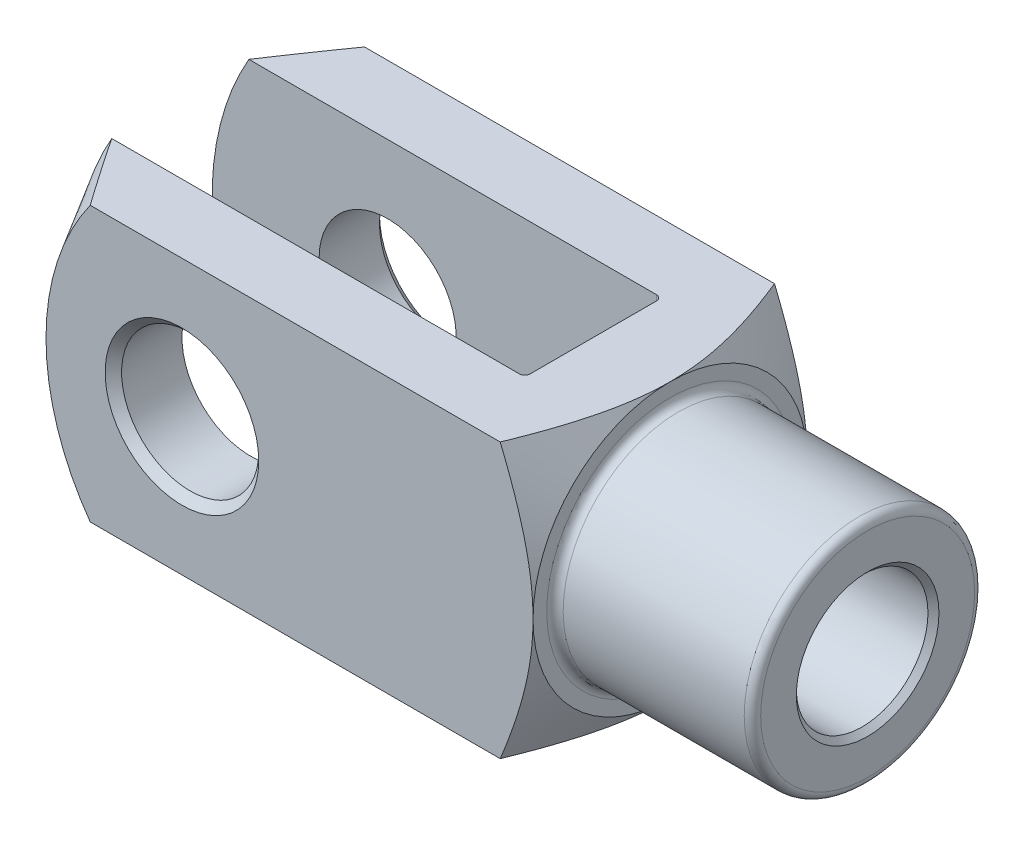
ISO-10303-21;
HEADER;
FILE_DESCRIPTION(('STEP AP214'),'2;1');
FILE_NAME('part.step','',(''),(''),'','','');
FILE_SCHEMA(('AUTOMOTIVE_DESIGN { 1 0 10303 214 1 1 1 1 }'));
ENDSEC;
DATA;
#1=APPLICATION_CONTEXT('core data for automotive mechanical design processes');
#2=APPLICATION_PROTOCOL_DEFINITION('international standard','automotive_design',2000,#1);
#3=PRODUCT_CONTEXT('',#1,'mechanical');
#4=PRODUCT('Part','Part','',(#3));
#5=PRODUCT_RELATED_PRODUCT_CATEGORY('part','',(#4));
#6=PRODUCT_DEFINITION_FORMATION('','',#4);
#7=PRODUCT_DEFINITION_CONTEXT('part definition',#1,'design');
#8=PRODUCT_DEFINITION('design','',#6,#7);
#9=PRODUCT_DEFINITION_SHAPE('','',#8);
#10=(LENGTH_UNIT() NAMED_UNIT(*) SI_UNIT(.MILLI.,.METRE.));
#11=(NAMED_UNIT(*) PLANE_ANGLE_UNIT() SI_UNIT($,.RADIAN.));
#12=(NAMED_UNIT(*) SI_UNIT($,.STERADIAN.) SOLID_ANGLE_UNIT());
#13=UNCERTAINTY_MEASURE_WITH_UNIT(LENGTH_MEASURE(1.E-05),#10,'distance_accuracy_value','');
#14=(GEOMETRIC_REPRESENTATION_CONTEXT(3) GLOBAL_UNCERTAINTY_ASSIGNED_CONTEXT((#13)) GLOBAL_UNIT_ASSIGNED_CONTEXT((#10,
#11,#12)) REPRESENTATION_CONTEXT('',''));
#15=CARTESIAN_POINT('',(0.,0.,0.));
#16=DIRECTION('',(0.,0.,1.));
#17=DIRECTION('',(1.,0.,0.));
#18=AXIS2_PLACEMENT_3D('',#15,#16,#17);
#19=CARTESIAN_POINT('',(-50.,-25.,-12.5));
#20=DIRECTION('',(1.,0.,0.));
#21=DIRECTION('',(0.,0.,-1.));
#22=AXIS2_PLACEMENT_3D('',#19,#20,#21);
#23=PLANE('',#22);
#24=DIRECTION('',(0.,1.,0.));
#25=VECTOR('',#24,1.);
#26=CARTESIAN_POINT('',(-50.,-25.,-11.5));
#27=LINE('',#26,#25);
#28=CARTESIAN_POINT('',(-50.,25.,-11.5));
#29=VERTEX_POINT('',#28);
#30=CARTESIAN_POINT('',(-50.,3.42782730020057,-11.5));
#31=VERTEX_POINT('',#30);
#32=EDGE_CURVE('E154',#29,#31,#27,.F.);
#33=ORIENTED_EDGE('',*,*,#32,.T.);
#34=CARTESIAN_POINT('',(-50.,0.,0.));
#35=DIRECTION('',(1.,0.,0.));
#36=DIRECTION('',(0.,0.,-1.));
#37=AXIS2_PLACEMENT_3D('',#34,#35,#36);
#38=CIRCLE('',#37,12.);
#39=CARTESIAN_POINT('',(-50.,3.42782730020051,11.5));
#40=VERTEX_POINT('',#39);
#41=EDGE_CURVE('E139',#31,#40,#38,.T.);
#42=ORIENTED_EDGE('',*,*,#41,.T.);
#43=DIRECTION('',(0.,1.,0.));
#44=VECTOR('',#43,1.);
#45=CARTESIAN_POINT('',(-50.,25.,11.5));
#46=LINE('',#45,#44);
#47=CARTESIAN_POINT('',(-50.,25.,11.5));
#48=VERTEX_POINT('',#47);
#49=EDGE_CURVE('E151',#40,#48,#46,.T.);
#50=ORIENTED_EDGE('',*,*,#49,.T.);
#51=DIRECTION('',(0.,0.,-1.));
#52=VECTOR('',#51,1.);
#53=CARTESIAN_POINT('',(-50.,25.,-12.5));
#54=LINE('',#53,#52);
#55=EDGE_CURVE('E329',#48,#29,#54,.T.);
#56=ORIENTED_EDGE('',*,*,#55,.T.);
#57=EDGE_LOOP('',(#33,#42,#50,#56));
#58=FACE_BOUND('',#57,.T.);
#59=ADVANCED_FACE('F37',(#58),#23,.F.);
#60=CARTESIAN_POINT('',(-132.,-25.,-12.5));
#61=DIRECTION('',(0.,0.,-1.));
#62=DIRECTION('',(-1.,0.,0.));
#63=AXIS2_PLACEMENT_3D('',#60,#61,#62);
#64=PLANE('',#63);
#65=CARTESIAN_POINT('',(-100.,0.,-12.5));
#66=DIRECTION('',(0.,0.,-1.));
#67=DIRECTION('',(-1.,0.,0.));
#68=AXIS2_PLACEMENT_3D('',#65,#66,#67);
#69=CIRCLE('',#68,12.5);
#70=CARTESIAN_POINT('',(-112.5,0.,-12.5));
#71=VERTEX_POINT('',#70);
#72=EDGE_CURVE('E358',#71,#71,#69,.F.);
#73=ORIENTED_EDGE('',*,*,#72,.F.);
#74=EDGE_LOOP('',(#73));
#75=FACE_BOUND('',#74,.T.);
#76=DIRECTION('',(-1.,0.,0.));
#77=VECTOR('',#76,1.);
#78=CARTESIAN_POINT('',(-132.,25.,-12.5));
#79=LINE('',#78,#77);
#80=CARTESIAN_POINT('',(-51.,25.,-12.5));
#81=VERTEX_POINT('',#80);
#82=CARTESIAN_POINT('',(-125.301270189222,25.,-12.5));
#83=VERTEX_POINT('',#82);
#84=EDGE_CURVE('E337',#81,#83,#79,.T.);
#85=ORIENTED_EDGE('',*,*,#84,.T.);
#86=CARTESIAN_POINT('',(-82.,0.,-12.5));
#87=DIRECTION('',(0.,0.,1.));
#88=DIRECTION('',(1.,0.,0.));
#89=AXIS2_PLACEMENT_3D('',#86,#87,#88);
#90=CIRCLE('',#89,50.);
#91=CARTESIAN_POINT('',(-125.301270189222,-25.,-12.5));
#92=VERTEX_POINT('',#91);
#93=EDGE_CURVE('E267',#83,#92,#90,.T.);
#94=ORIENTED_EDGE('',*,*,#93,.T.);
#95=DIRECTION('',(-1.,0.,0.));
#96=VECTOR('',#95,1.);
#97=CARTESIAN_POINT('',(-132.,-25.,-12.5));
#98=LINE('',#97,#96);
#99=CARTESIAN_POINT('',(-51.,-25.,-12.5));
#100=VERTEX_POINT('',#99);
#101=EDGE_CURVE('E324',#100,#92,#98,.T.);
#102=ORIENTED_EDGE('',*,*,#101,.F.);
#103=DIRECTION('',(0.,1.,0.));
#104=VECTOR('',#103,1.);
#105=CARTESIAN_POINT('',(-51.,25.,-12.5));
#106=LINE('',#105,#104);
#107=EDGE_CURVE('E178',#100,#81,#106,.T.);
#108=ORIENTED_EDGE('',*,*,#107,.T.);
#109=EDGE_LOOP('',(#85,#94,#102,#108));
#110=FACE_BOUND('',#109,.T.);
#111=ADVANCED_FACE('F367',(#75,#110),#64,.F.);
#112=CARTESIAN_POINT('',(-132.,-25.,12.5));
#113=DIRECTION('',(0.,0.,1.));
#114=DIRECTION('',(1.,0.,0.));
#115=AXIS2_PLACEMENT_3D('',#112,#113,#114);
#116=PLANE('',#115);
#117=CARTESIAN_POINT('',(-100.,0.,12.5));
#118=DIRECTION('',(0.,0.,1.));
#119=DIRECTION('',(1.,0.,0.));
#120=AXIS2_PLACEMENT_3D('',#117,#118,#119);
#121=CIRCLE('',#120,12.5);
#122=CARTESIAN_POINT('',(-87.5,0.,12.5));
#123=VERTEX_POINT('',#122);
#124=EDGE_CURVE('E336',#123,#123,#121,.F.);
#125=ORIENTED_EDGE('',*,*,#124,.F.);
#126=EDGE_LOOP('',(#125));
#127=FACE_BOUND('',#126,.T.);
#128=CARTESIAN_POINT('',(-82.,0.,12.5));
#129=DIRECTION('',(0.,0.,1.));
#130=DIRECTION('',(1.,0.,0.));
#131=AXIS2_PLACEMENT_3D('',#128,#129,#130);
#132=CIRCLE('',#131,50.);
#133=CARTESIAN_POINT('',(-125.301270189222,25.,12.5));
#134=VERTEX_POINT('',#133);
#135=CARTESIAN_POINT('',(-125.301270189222,-25.,12.5));
#136=VERTEX_POINT('',#135);
#137=EDGE_CURVE('E386',#134,#136,#132,.T.);
#138=ORIENTED_EDGE('',*,*,#137,.F.);
#139=DIRECTION('',(1.,0.,0.));
#140=VECTOR('',#139,1.);
#141=CARTESIAN_POINT('',(-132.,25.,12.5));
#142=LINE('',#141,#140);
#143=CARTESIAN_POINT('',(-51.,25.,12.5));
#144=VERTEX_POINT('',#143);
#145=EDGE_CURVE('E341',#134,#144,#142,.T.);
#146=ORIENTED_EDGE('',*,*,#145,.T.);
#147=DIRECTION('',(0.,1.,0.));
#148=VECTOR('',#147,1.);
#149=CARTESIAN_POINT('',(-51.,-25.,12.5));
#150=LINE('',#149,#148);
#151=CARTESIAN_POINT('',(-51.,-25.,12.5));
#152=VERTEX_POINT('',#151);
#153=EDGE_CURVE('E169',#144,#152,#150,.F.);
#154=ORIENTED_EDGE('',*,*,#153,.T.);
#155=DIRECTION('',(1.,0.,0.));
#156=VECTOR('',#155,1.);
#157=CARTESIAN_POINT('',(-132.,-25.,12.5));
#158=LINE('',#157,#156);
#159=EDGE_CURVE('E328',#136,#152,#158,.T.);
#160=ORIENTED_EDGE('',*,*,#159,.F.);
#161=EDGE_LOOP('',(#138,#146,#154,#160));
#162=FACE_BOUND('',#161,.T.);
#163=ADVANCED_FACE('F370',(#127,#162),#116,.F.);
#164=CARTESIAN_POINT('',(-132.,-25.,25.));
#165=DIRECTION('',(0.,0.,1.));
#166=DIRECTION('',(1.,0.,0.));
#167=AXIS2_PLACEMENT_3D('',#164,#165,#166);
#168=PLANE('',#167);
#169=CARTESIAN_POINT('',(-100.,0.,25.));
#170=DIRECTION('',(0.,0.,1.));
#171=DIRECTION('',(1.,0.,0.));
#172=AXIS2_PLACEMENT_3D('',#169,#170,#171);
#173=CIRCLE('',#172,14.);
#174=CARTESIAN_POINT('',(-86.,0.,25.));
#175=VERTEX_POINT('',#174);
#176=EDGE_CURVE('E221',#175,#175,#173,.F.);
#177=ORIENTED_EDGE('',*,*,#176,.T.);
#178=EDGE_LOOP('',(#177));
#179=FACE_BOUND('',#178,.T.);
#180=DIRECTION('',(1.,0.,0.));
#181=VECTOR('',#180,1.);
#182=CARTESIAN_POINT('',(-132.,25.,25.));
#183=LINE('',#182,#181);
#184=CARTESIAN_POINT('',(-116.718806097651,25.,25.));
#185=VERTEX_POINT('',#184);
#186=CARTESIAN_POINT('',(-41.9786577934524,25.,25.));
#187=VERTEX_POINT('',#186);
#188=EDGE_CURVE('E355',#185,#187,#183,.T.);
#189=ORIENTED_EDGE('',*,*,#188,.F.);
#190=CARTESIAN_POINT('',(-82.,0.,25.));
#191=DIRECTION('',(0.,0.,1.));
#192=DIRECTION('',(1.,0.,0.));
#193=AXIS2_PLACEMENT_3D('',#190,#191,#192);
#194=CIRCLE('',#193,42.7831216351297);
#195=CARTESIAN_POINT('',(-116.718806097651,-25.,25.));
#196=VERTEX_POINT('',#195);
#197=EDGE_CURVE('E61',#185,#196,#194,.T.);
#198=ORIENTED_EDGE('',*,*,#197,.T.);
#199=DIRECTION('',(1.,0.,0.));
#200=VECTOR('',#199,1.);
#201=CARTESIAN_POINT('',(-132.,-25.,25.));
#202=LINE('',#201,#200);
#203=CARTESIAN_POINT('',(-41.9786577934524,-25.,25.));
#204=VERTEX_POINT('',#203);
#205=EDGE_CURVE('E352',#196,#204,#202,.T.);
#206=ORIENTED_EDGE('',*,*,#205,.T.);
#207=CARTESIAN_POINT('',(-54.3896836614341,-51.060108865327,25.));
#208=CARTESIAN_POINT('',(-54.0702396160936,-50.4440491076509,25.));
#209=CARTESIAN_POINT('',(-53.7516711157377,-49.8275355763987,25.));
#210=CARTESIAN_POINT('',(-53.1164723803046,-48.5935084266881,25.));
#211=CARTESIAN_POINT('',(-52.7998421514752,-47.9759948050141,25.));
#212=CARTESIAN_POINT('',(-51.8531108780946,-46.121758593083,25.));
#213=CARTESIAN_POINT('',(-51.2262015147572,-44.883402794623,25.));
#214=CARTESIAN_POINT('',(-49.9817262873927,-42.3993024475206,25.));
#215=CARTESIAN_POINT('',(-49.36417859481,-41.1535487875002,25.));
#216=CARTESIAN_POINT('',(-48.1420641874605,-38.6556994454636,25.));
#217=CARTESIAN_POINT('',(-47.5374972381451,-37.4036038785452,25.));
#218=CARTESIAN_POINT('',(-46.6245616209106,-35.4809975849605,25.));
#219=CARTESIAN_POINT('',(-46.3103202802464,-34.8132740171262,25.));
#220=CARTESIAN_POINT('',(-45.6870848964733,-33.4753840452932,25.));
#221=CARTESIAN_POINT('',(-45.3780908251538,-32.8052176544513,25.));
#222=CARTESIAN_POINT('',(-44.7660612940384,-31.4621154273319,25.));
#223=CARTESIAN_POINT('',(-44.4630262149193,-30.7891794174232,25.));
#224=CARTESIAN_POINT('',(-43.8638047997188,-29.4402678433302,25.));
#225=CARTESIAN_POINT('',(-43.567618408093,-28.7642923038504,25.));
#226=CARTESIAN_POINT('',(-42.9832401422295,-27.4092342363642,25.));
#227=CARTESIAN_POINT('',(-42.6950448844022,-26.7301531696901,25.));
#228=CARTESIAN_POINT('',(-42.1277277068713,-25.3682139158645,25.));
#229=CARTESIAN_POINT('',(-41.8486056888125,-24.6853557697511,25.));
#230=CARTESIAN_POINT('',(-41.3008836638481,-23.3154936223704,25.));
#231=CARTESIAN_POINT('',(-41.0322827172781,-22.6284899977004,25.));
#232=CARTESIAN_POINT('',(-40.5072699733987,-21.2498439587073,25.));
#233=CARTESIAN_POINT('',(-40.2508580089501,-20.5582016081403,25.));
#234=CARTESIAN_POINT('',(-39.6981186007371,-19.0192644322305,25.));
#235=CARTESIAN_POINT('',(-39.4051931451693,-18.1707404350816,25.));
#236=CARTESIAN_POINT('',(-38.8445496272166,-16.4654408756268,25.));
#237=CARTESIAN_POINT('',(-38.5768294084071,-15.6086660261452,25.));
#238=CARTESIAN_POINT('',(-38.0715655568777,-13.8862208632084,25.));
#239=CARTESIAN_POINT('',(-37.8340212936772,-13.020550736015,25.));
#240=CARTESIAN_POINT('',(-37.3947833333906,-11.2800851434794,25.));
#241=CARTESIAN_POINT('',(-37.1930892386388,-10.4052897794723,25.));
#242=CARTESIAN_POINT('',(-36.8358725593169,-8.66764738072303,25.));
#243=CARTESIAN_POINT('',(-36.6793772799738,-7.8050019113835,25.));
#244=CARTESIAN_POINT('',(-36.4118970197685,-6.07256603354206,25.));
#245=CARTESIAN_POINT('',(-36.3009105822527,-5.20277585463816,25.));
#246=CARTESIAN_POINT('',(-36.1719961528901,-3.89473366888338,25.));
#247=CARTESIAN_POINT('',(-36.1352902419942,-3.45827475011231,25.));
#248=CARTESIAN_POINT('',(-36.0747637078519,-2.58447126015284,25.));
#249=CARTESIAN_POINT('',(-36.0509424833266,-2.14712673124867,25.));
#250=CARTESIAN_POINT('',(-36.0164702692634,-1.27191768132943,25.));
#251=CARTESIAN_POINT('',(-36.0058192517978,-0.834053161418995,25.));
#252=CARTESIAN_POINT('',(-35.997804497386,0.041783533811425,25.));
#253=CARTESIAN_POINT('',(-36.0004406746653,0.4797557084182,25.));
#254=CARTESIAN_POINT('',(-36.0269227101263,1.72941799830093,25.));
#255=CARTESIAN_POINT('',(-36.0669600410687,2.54082045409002,25.));
#256=CARTESIAN_POINT('',(-36.191134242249,4.16015553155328,25.));
#257=CARTESIAN_POINT('',(-36.2752710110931,4.96808816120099,25.));
#258=CARTESIAN_POINT('',(-36.4845414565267,6.57900346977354,25.));
#259=CARTESIAN_POINT('',(-36.6096963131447,7.381983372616,25.));
#260=CARTESIAN_POINT('',(-36.8968815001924,8.9812761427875,25.));
#261=CARTESIAN_POINT('',(-37.0589128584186,9.77758882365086,25.));
#262=CARTESIAN_POINT('',(-37.4205003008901,11.3858202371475,25.));
#263=CARTESIAN_POINT('',(-37.6210067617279,12.1975235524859,25.));
#264=CARTESIAN_POINT('',(-38.0514548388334,13.8130498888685,25.));
#265=CARTESIAN_POINT('',(-38.2813967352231,14.6168728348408,25.));
#266=CARTESIAN_POINT('',(-38.6450498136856,15.8168480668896,25.));
#267=CARTESIAN_POINT('',(-38.7693896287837,16.2158762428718,25.));
#268=CARTESIAN_POINT('',(-39.0238248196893,17.0120965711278,25.));
#269=CARTESIAN_POINT('',(-39.1539201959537,17.4092887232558,25.));
#270=CARTESIAN_POINT('',(-39.4193862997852,18.2018774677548,25.));
#271=CARTESIAN_POINT('',(-39.5547567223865,18.5972741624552,25.));
#272=CARTESIAN_POINT('',(-39.8303487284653,19.3863688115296,25.));
#273=CARTESIAN_POINT('',(-39.9705702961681,19.7800667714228,25.));
#274=CARTESIAN_POINT('',(-40.4211198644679,21.0227726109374,25.));
#275=CARTESIAN_POINT('',(-40.7396291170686,21.8688223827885,25.));
#276=CARTESIAN_POINT('',(-41.3939408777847,23.5542282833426,25.));
#277=CARTESIAN_POINT('',(-41.7297444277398,24.3935840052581,25.));
#278=CARTESIAN_POINT('',(-42.4158526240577,26.0665557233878,25.));
#279=CARTESIAN_POINT('',(-42.7661605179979,26.9001703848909,25.));
#280=CARTESIAN_POINT('',(-43.4788643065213,28.5621850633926,25.));
#281=CARTESIAN_POINT('',(-43.8412599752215,29.3905851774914,25.));
#282=CARTESIAN_POINT('',(-44.5765639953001,31.0435554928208,25.));
#283=CARTESIAN_POINT('',(-44.9494811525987,31.8681217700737,25.));
#284=CARTESIAN_POINT('',(-45.7039754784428,33.5132807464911,25.));
#285=CARTESIAN_POINT('',(-46.0855526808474,34.3338734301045,25.));
#286=CARTESIAN_POINT('',(-46.8560487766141,35.9714875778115,25.));
#287=CARTESIAN_POINT('',(-47.2449668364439,36.7885094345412,25.));
#288=CARTESIAN_POINT('',(-48.0291380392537,38.4195026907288,25.));
#289=CARTESIAN_POINT('',(-48.4243911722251,39.2334740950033,25.));
#290=CARTESIAN_POINT('',(-49.2215760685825,40.8612119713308,25.));
#291=CARTESIAN_POINT('',(-49.6235245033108,41.6749702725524,25.));
#292=CARTESIAN_POINT('',(-50.4321982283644,43.3001111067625,25.));
#293=CARTESIAN_POINT('',(-50.8389235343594,44.1114936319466,25.));
#294=CARTESIAN_POINT('',(-52.0653366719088,46.542528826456,25.));
#295=CARTESIAN_POINT('',(-52.8912486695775,48.1590425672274,25.));
#296=CARTESIAN_POINT('',(-54.5554400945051,51.3846655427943,25.));
#297=CARTESIAN_POINT('',(-55.3937132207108,52.993778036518,25.));
#298=CARTESIAN_POINT('',(-57.0803096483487,56.206707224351,25.));
#299=CARTESIAN_POINT('',(-57.9286328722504,57.810523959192,25.));
#300=CARTESIAN_POINT('',(-59.5067418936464,60.7760111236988,25.));
#301=CARTESIAN_POINT('',(-60.2354219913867,62.1382706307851,25.));
#302=CARTESIAN_POINT('',(-61.6976641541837,64.8601683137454,25.));
#303=CARTESIAN_POINT('',(-62.431226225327,66.2198064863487,25.));
#304=CARTESIAN_POINT('',(-63.9025703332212,68.9370430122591,25.));
#305=CARTESIAN_POINT('',(-64.6403529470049,70.2946410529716,25.));
#306=CARTESIAN_POINT('',(-66.1194235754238,73.0079264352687,25.));
#307=CARTESIAN_POINT('',(-66.8607115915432,74.363613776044,25.));
#308=CARTESIAN_POINT('',(-68.3420387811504,77.0655790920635,25.));
#309=CARTESIAN_POINT('',(-69.0820607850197,78.4118664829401,25.));
#310=CARTESIAN_POINT('',(-70.5646748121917,81.1030256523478,25.));
#311=CARTESIAN_POINT('',(-71.3072668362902,82.4478974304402,25.));
#312=CARTESIAN_POINT('',(-72.7945668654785,85.1361925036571,25.));
#313=CARTESIAN_POINT('',(-73.5392745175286,86.4796159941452,25.));
#314=CARTESIAN_POINT('',(-75.0306524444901,89.1653712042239,25.));
#315=CARTESIAN_POINT('',(-75.7773227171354,90.5077029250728,25.));
#316=CARTESIAN_POINT('',(-76.5248400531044,91.8495622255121,25.));
#317=B_SPLINE_CURVE_WITH_KNOTS('',3,(#207,#208,#209,#210,#211,#212,#213,#214,#215,#216,#217,
#218,#219,#220,#221,#222,#223,#224,#225,#226,#227,#228,#229,#230,#231,#232,#233,#234,#235,#236,
#237,#238,#239,#240,#241,#242,#243,#244,#245,#246,#247,#248,#249,#250,#251,#252,#253,#254,#255,
#256,#257,#258,#259,#260,#261,#262,#263,#264,#265,#266,#267,#268,#269,#270,#271,#272,#273,#274,
#275,#276,#277,#278,#279,#280,#281,#282,#283,#284,#285,#286,#287,#288,#289,#290,#291,#292,#293,
#294,#295,#296,#297,#298,#299,#300,#301,#302,#303,#304,#305,#306,#307,#308,#309,#310,#311,#312,
#313,#314,#315,#316),.UNSPECIFIED.,.F.,.F.,(4,2,2,2,2,2,2,2,2,2,2,2,2,2,2,2,2,2,2,2,2,2,2,2,2,2,
2,2,2,2,2,2,2,2,2,2,2,2,2,2,2,2,2,2,2,2,2,2,2,2,2,2,2,2,4),(0.,2.0818647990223,4.16373630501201,
8.3276893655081,12.4988933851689,16.6700219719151,18.8839190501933,21.0978042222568,
23.3118303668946,25.5258385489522,27.7388945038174,29.9519264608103,32.1647603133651,
34.3775638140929,37.0702188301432,39.7626432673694,42.4550114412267,45.1473497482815,
47.7764878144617,50.4055417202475,51.7193813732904,53.0331597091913,54.3469352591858,
55.6607023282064,58.0965060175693,60.5323041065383,62.969361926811,65.4064876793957,
67.9141539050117,70.4218439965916,71.6756655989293,72.9294873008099,74.1832366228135,
75.4369818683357,78.1487780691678,80.8607378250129,83.5733081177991,86.2858277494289,
89.0006892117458,91.7155612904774,94.4301269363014,97.1446882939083,99.8675153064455,
102.59035125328,108.03611189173,113.479186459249,118.922219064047,123.556917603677,
128.191621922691,132.826975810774,137.462331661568,142.071135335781,146.679940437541,
151.288017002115,155.896088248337),.UNSPECIFIED.);
#318=CARTESIAN_POINT('',(-36.,0.,25.));
#319=VERTEX_POINT('',#318);
#320=EDGE_CURVE('E296',#319,#204,#317,.F.);
#321=ORIENTED_EDGE('',*,*,#320,.F.);
#322=EDGE_CURVE('E294',#187,#319,#317,.F.);
#323=ORIENTED_EDGE('',*,*,#322,.F.);
#324=EDGE_LOOP('',(#189,#198,#206,#321,#323));
#325=FACE_BOUND('',#324,.T.);
#326=ADVANCED_FACE('F278',(#179,#325),#168,.T.);
#327=CARTESIAN_POINT('',(-132.,-25.,25.));
#328=DIRECTION('',(0.,-1.,0.));
#329=DIRECTION('',(0.,0.,-1.));
#330=AXIS2_PLACEMENT_3D('',#327,#328,#329);
#331=PLANE('',#330);
#332=ORIENTED_EDGE('',*,*,#101,.T.);
#333=CARTESIAN_POINT('',(-145.080288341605,-25.,18.4234921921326));
#334=CARTESIAN_POINT('',(-144.472127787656,-25.,17.4442349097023));
#335=CARTESIAN_POINT('',(-143.863110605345,-25.,16.4655096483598));
#336=CARTESIAN_POINT('',(-142.64320100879,-25.,14.5092279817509));
#337=CARTESIAN_POINT('',(-142.032308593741,-25.,13.5316715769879));
#338=CARTESIAN_POINT('',(-140.196552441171,-25.,10.6008760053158));
#339=CARTESIAN_POINT('',(-138.968633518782,-25.,8.64954870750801));
#340=CARTESIAN_POINT('',(-136.501582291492,-25.,4.75072735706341));
#341=CARTESIAN_POINT('',(-135.262438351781,-25.,2.80324065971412));
#342=CARTESIAN_POINT('',(-133.394839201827,-25.,-0.112283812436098));
#343=CARTESIAN_POINT('',(-132.770828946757,-25.,-1.08316923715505));
#344=CARTESIAN_POINT('',(-131.519511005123,-25.,-3.02282119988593));
#345=CARTESIAN_POINT('',(-130.892203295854,-25.,-3.99158772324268));
#346=CARTESIAN_POINT('',(-128.95244702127,-25.,-6.97489606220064));
#347=CARTESIAN_POINT('',(-127.633918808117,-25.,-8.98549817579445));
#348=CARTESIAN_POINT('',(-125.641173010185,-25.,-11.9914731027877));
#349=CARTESIAN_POINT('',(-124.974434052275,-25.,-12.9918072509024));
#350=CARTESIAN_POINT('',(-123.635287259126,-25.,-14.9886724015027));
#351=CARTESIAN_POINT('',(-122.962879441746,-25.,-15.9852034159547));
#352=CARTESIAN_POINT('',(-121.612110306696,-25.,-17.9731515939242));
#353=CARTESIAN_POINT('',(-120.93375374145,-25.,-18.9645719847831));
#354=CARTESIAN_POINT('',(-119.569655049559,-25.,-20.9423259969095));
#355=CARTESIAN_POINT('',(-118.883912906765,-25.,-21.9286596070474));
#356=CARTESIAN_POINT('',(-117.503939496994,-25.,-23.8953083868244));
#357=CARTESIAN_POINT('',(-116.809708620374,-25.,-24.8756238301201));
#358=CARTESIAN_POINT('',(-115.411345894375,-25.,-26.8291605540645));
#359=CARTESIAN_POINT('',(-114.707214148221,-25.,-27.8023819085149));
#360=CARTESIAN_POINT('',(-113.293944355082,-25.,-29.7312915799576));
#361=CARTESIAN_POINT('',(-112.584914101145,-25.,-30.6870587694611));
#362=CARTESIAN_POINT('',(-111.153353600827,-25.,-32.588477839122));
#363=CARTESIAN_POINT('',(-110.430823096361,-25.,-33.5341295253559));
#364=CARTESIAN_POINT('',(-108.968647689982,-25.,-35.4142141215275));
#365=CARTESIAN_POINT('',(-108.228980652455,-25.,-36.3486298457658));
#366=CARTESIAN_POINT('',(-106.730154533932,-25.,-38.2016880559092));
#367=CARTESIAN_POINT('',(-105.970996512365,-25.,-39.1203313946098));
#368=CARTESIAN_POINT('',(-104.818318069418,-25.,-40.4783705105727));
#369=CARTESIAN_POINT('',(-104.433821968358,-25.,-40.9254343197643));
#370=CARTESIAN_POINT('',(-103.658306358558,-25.,-41.8138621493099));
#371=CARTESIAN_POINT('',(-103.267286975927,-25.,-42.2552262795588));
#372=CARTESIAN_POINT('',(-102.477863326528,-25.,-43.1315371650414));
#373=CARTESIAN_POINT('',(-102.07945697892,-25.,-43.5664820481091));
#374=CARTESIAN_POINT('',(-101.274508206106,-25.,-44.4287818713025));
#375=CARTESIAN_POINT('',(-100.867965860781,-25.,-44.8561368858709));
#376=CARTESIAN_POINT('',(-100.046668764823,-25.,-45.701042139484));
#377=CARTESIAN_POINT('',(-99.6319344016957,-25.,-46.1186121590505));
#378=CARTESIAN_POINT('',(-98.7922215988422,-25.,-46.9433872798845));
#379=CARTESIAN_POINT('',(-98.3672426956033,-25.,-47.3505919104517));
#380=CARTESIAN_POINT('',(-97.5060078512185,-25.,-48.1524328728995));
#381=CARTESIAN_POINT('',(-97.0697583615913,-25.,-48.5470761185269));
#382=CARTESIAN_POINT('',(-96.1843373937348,-25.,-49.3215389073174));
#383=CARTESIAN_POINT('',(-95.7351678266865,-25.,-49.7013606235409));
#384=CARTESIAN_POINT('',(-95.0423543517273,-25.,-50.2642508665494));
#385=CARTESIAN_POINT('',(-94.8040357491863,-25.,-50.4538860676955));
#386=CARTESIAN_POINT('',(-94.3232489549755,-25.,-50.8278161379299));
#387=CARTESIAN_POINT('',(-94.0807807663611,-25.,-51.0121110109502));
#388=CARTESIAN_POINT('',(-93.3466799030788,-25.,-51.5562074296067));
#389=CARTESIAN_POINT('',(-92.8484147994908,-25.,-51.9071684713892));
#390=CARTESIAN_POINT('',(-91.8327862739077,-25.,-52.579524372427));
#391=CARTESIAN_POINT('',(-91.3154382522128,-25.,-52.9009423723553));
#392=CARTESIAN_POINT('',(-90.2597150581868,-25.,-53.5073081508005));
#393=CARTESIAN_POINT('',(-89.721345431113,-25.,-53.7922654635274));
#394=CARTESIAN_POINT('',(-88.7482738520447,-25.,-54.2570284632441));
#395=CARTESIAN_POINT('',(-88.3179565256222,-25.,-54.4459895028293));
#396=CARTESIAN_POINT('',(-87.4447220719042,-25.,-54.7923456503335));
#397=CARTESIAN_POINT('',(-87.0018060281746,-25.,-54.9497434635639));
#398=CARTESIAN_POINT('',(-86.1052102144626,-25.,-55.2279936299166));
#399=CARTESIAN_POINT('',(-85.6515463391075,-25.,-55.3488967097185));
#400=CARTESIAN_POINT('',(-84.7352048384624,-25.,-55.5499885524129));
#401=CARTESIAN_POINT('',(-84.2725276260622,-25.,-55.63017917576));
#402=CARTESIAN_POINT('',(-83.3369335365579,-25.,-55.7469995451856));
#403=CARTESIAN_POINT('',(-82.863960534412,-25.,-55.7831858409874));
#404=CARTESIAN_POINT('',(-81.9167547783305,-25.,-55.8087980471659));
#405=CARTESIAN_POINT('',(-81.4425220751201,-25.,-55.7982258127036));
#406=CARTESIAN_POINT('',(-80.4972968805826,-25.,-55.7308315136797));
#407=CARTESIAN_POINT('',(-80.0263050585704,-25.,-55.6740001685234));
#408=CARTESIAN_POINT('',(-79.0916982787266,-25.,-55.5167043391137));
#409=CARTESIAN_POINT('',(-78.6280844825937,-25.,-55.4162330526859));
#410=CARTESIAN_POINT('',(-77.6263398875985,-25.,-55.1534627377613));
#411=CARTESIAN_POINT('',(-77.0903179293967,-25.,-54.9831572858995));
#412=CARTESIAN_POINT('',(-76.0358435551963,-25.,-54.5950590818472));
#413=CARTESIAN_POINT('',(-75.5173965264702,-25.,-54.3772519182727));
#414=CARTESIAN_POINT('',(-74.4975214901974,-25.,-53.9014837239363));
#415=CARTESIAN_POINT('',(-73.9961502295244,-25.,-53.6434022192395));
#416=CARTESIAN_POINT('',(-73.0117477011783,-25.,-53.0947741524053));
#417=CARTESIAN_POINT('',(-72.5287143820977,-25.,-52.8042312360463));
#418=CARTESIAN_POINT('',(-71.4240950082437,-25.,-52.0970110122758));
#419=CARTESIAN_POINT('',(-70.809011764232,-25.,-51.6702126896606));
#420=CARTESIAN_POINT('',(-69.6052253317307,-25.,-50.7806794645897));
#421=CARTESIAN_POINT('',(-69.0165360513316,-25.,-50.3179259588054));
#422=CARTESIAN_POINT('',(-67.86112354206,-25.,-49.3637360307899));
#423=CARTESIAN_POINT('',(-67.2944444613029,-25.,-48.8722464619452));
#424=CARTESIAN_POINT('',(-66.1810865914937,-25.,-47.8674233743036));
#425=CARTESIAN_POINT('',(-65.634404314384,-25.,-47.3540936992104));
#426=CARTESIAN_POINT('',(-64.5545082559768,-25.,-46.3064086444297));
#427=CARTESIAN_POINT('',(-64.0214091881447,-25.,-45.7719354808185));
#428=CARTESIAN_POINT('',(-62.9700700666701,-25.,-44.6885777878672));
#429=CARTESIAN_POINT('',(-62.4518305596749,-25.,-44.1396927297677));
#430=CARTESIAN_POINT('',(-61.4287324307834,-25.,-43.0306741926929));
#431=CARTESIAN_POINT('',(-60.9238604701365,-25.,-42.47055298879));
#432=CARTESIAN_POINT('',(-59.9252668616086,-25.,-41.3405006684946));
#433=CARTESIAN_POINT('',(-59.4315449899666,-25.,-40.7705697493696));
#434=CARTESIAN_POINT('',(-58.2511889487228,-25.,-39.3845205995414));
#435=CARTESIAN_POINT('',(-57.5694107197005,-25.,-38.5642689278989));
#436=CARTESIAN_POINT('',(-56.2219000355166,-25.,-36.9104674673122));
#437=CARTESIAN_POINT('',(-55.5561707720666,-25.,-36.076915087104));
#438=CARTESIAN_POINT('',(-54.2484285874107,-25.,-34.4119795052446));
#439=CARTESIAN_POINT('',(-53.6062085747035,-25.,-33.5807587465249));
#440=CARTESIAN_POINT('',(-52.6514215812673,-25.,-32.3276338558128));
#441=CARTESIAN_POINT('',(-52.3346290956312,-25.,-31.908938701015));
#442=CARTESIAN_POINT('',(-51.703658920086,-25.,-31.0695887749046));
#443=CARTESIAN_POINT('',(-51.3894812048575,-25.,-30.6489340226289));
#444=CARTESIAN_POINT('',(-51.0765078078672,-25.,-30.2273844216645));
#445=B_SPLINE_CURVE_WITH_KNOTS('',3,(#333,#334,#335,#336,#337,#338,#339,#340,#341,#342,#343,
#344,#345,#346,#347,#348,#349,#350,#351,#352,#353,#354,#355,#356,#357,#358,#359,#360,#361,#362,
#363,#364,#365,#366,#367,#368,#369,#370,#371,#372,#373,#374,#375,#376,#377,#378,#379,#380,#381,
#382,#383,#384,#385,#386,#387,#388,#389,#390,#391,#392,#393,#394,#395,#396,#397,#398,#399,#400,
#401,#402,#403,#404,#405,#406,#407,#408,#409,#410,#411,#412,#413,#414,#415,#416,#417,#418,#419,
#420,#421,#422,#423,#424,#425,#426,#427,#428,#429,#430,#431,#432,#433,#434,#435,#436,#437,#438,
#439,#440,#441,#442,#443,#444),.UNSPECIFIED.,.F.,.F.,(4,2,2,2,2,2,2,2,2,2,2,2,2,2,2,2,2,2,2,2,2,
2,2,2,2,2,2,2,2,2,2,2,2,2,2,2,2,2,2,2,2,2,2,2,2,2,2,2,2,2,2,2,2,2,2,4),(0.,3.4582122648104,
6.91642601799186,13.8329884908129,20.7578064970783,24.2201787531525,27.6825748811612,
34.8955969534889,38.5020877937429,42.1085672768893,45.7123890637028,49.3162187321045,
52.9198832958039,56.5235103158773,60.0935571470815,63.6636722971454,67.2386891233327,
70.8135120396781,72.5824521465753,74.3513580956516,76.1207701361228,77.890164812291,
79.6556045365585,81.4211242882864,83.1856548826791,84.9499257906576,85.8635405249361,
86.7771545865,88.6046301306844,90.4306618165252,92.256215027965,93.6651016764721,
95.0738675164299,96.4806660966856,97.8874003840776,99.3081964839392,100.728936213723,
102.149961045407,103.57120745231,105.255783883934,106.940872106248,108.63110118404,
110.321140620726,112.565337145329,114.810702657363,117.060361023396,119.309625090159,
121.57395208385,123.838362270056,126.100420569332,128.362433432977,131.56196291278,
134.762123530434,137.913252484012,139.488353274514,141.063438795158),.UNSPECIFIED.);
#446=CARTESIAN_POINT('',(-116.718806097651,-25.,-25.));
#447=VERTEX_POINT('',#446);
#448=EDGE_CURVE('E266',#92,#447,#445,.T.);
#449=ORIENTED_EDGE('',*,*,#448,.T.);
#450=DIRECTION('',(1.,0.,0.));
#451=VECTOR('',#450,1.);
#452=CARTESIAN_POINT('',(-132.,-25.,-25.));
#453=LINE('',#452,#451);
#454=CARTESIAN_POINT('',(-41.9786577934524,-25.,-25.));
#455=VERTEX_POINT('',#454);
#456=EDGE_CURVE('E349',#447,#455,#453,.T.);
#457=ORIENTED_EDGE('',*,*,#456,.T.);
#458=CARTESIAN_POINT('',(-54.3896836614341,-25.,-51.060108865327));
#459=CARTESIAN_POINT('',(-54.0702396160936,-25.,-50.4440491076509));
#460=CARTESIAN_POINT('',(-53.7516711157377,-25.,-49.8275355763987));
#461=CARTESIAN_POINT('',(-53.1164723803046,-25.,-48.5935084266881));
#462=CARTESIAN_POINT('',(-52.7998421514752,-25.,-47.9759948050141));
#463=CARTESIAN_POINT('',(-51.8531108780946,-25.,-46.121758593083));
#464=CARTESIAN_POINT('',(-51.2262015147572,-25.,-44.883402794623));
#465=CARTESIAN_POINT('',(-49.9817262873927,-25.,-42.3993024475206));
#466=CARTESIAN_POINT('',(-49.36417859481,-25.,-41.1535487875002));
#467=CARTESIAN_POINT('',(-48.1420641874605,-25.,-38.6556994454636));
#468=CARTESIAN_POINT('',(-47.5374972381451,-25.,-37.4036038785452));
#469=CARTESIAN_POINT('',(-46.6245616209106,-25.,-35.4809975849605));
#470=CARTESIAN_POINT('',(-46.3103202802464,-25.,-34.8132740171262));
#471=CARTESIAN_POINT('',(-45.6870848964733,-25.,-33.4753840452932));
#472=CARTESIAN_POINT('',(-45.3780908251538,-25.,-32.8052176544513));
#473=CARTESIAN_POINT('',(-44.7660612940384,-25.,-31.4621154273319));
#474=CARTESIAN_POINT('',(-44.4630262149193,-25.,-30.7891794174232));
#475=CARTESIAN_POINT('',(-43.8638047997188,-25.,-29.4402678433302));
#476=CARTESIAN_POINT('',(-43.567618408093,-25.,-28.7642923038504));
#477=CARTESIAN_POINT('',(-42.9832401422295,-25.,-27.4092342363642));
#478=CARTESIAN_POINT('',(-42.6950448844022,-25.,-26.7301531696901));
#479=CARTESIAN_POINT('',(-42.1277277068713,-25.,-25.3682139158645));
#480=CARTESIAN_POINT('',(-41.8486056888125,-25.,-24.6853557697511));
#481=CARTESIAN_POINT('',(-41.3008836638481,-25.,-23.3154936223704));
#482=CARTESIAN_POINT('',(-41.0322827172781,-25.,-22.6284899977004));
#483=CARTESIAN_POINT('',(-40.5072699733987,-25.,-21.2498439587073));
#484=CARTESIAN_POINT('',(-40.2508580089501,-25.,-20.5582016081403));
#485=CARTESIAN_POINT('',(-39.6981186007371,-25.,-19.0192644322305));
#486=CARTESIAN_POINT('',(-39.4051931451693,-25.,-18.1707404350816));
#487=CARTESIAN_POINT('',(-38.8445496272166,-25.,-16.4654408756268));
#488=CARTESIAN_POINT('',(-38.5768294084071,-25.,-15.6086660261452));
#489=CARTESIAN_POINT('',(-38.0715655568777,-25.,-13.8862208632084));
#490=CARTESIAN_POINT('',(-37.8340212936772,-25.,-13.020550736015));
#491=CARTESIAN_POINT('',(-37.3947833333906,-25.,-11.2800851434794));
#492=CARTESIAN_POINT('',(-37.1930892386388,-25.,-10.4052897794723));
#493=CARTESIAN_POINT('',(-36.8358725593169,-25.,-8.66764738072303));
#494=CARTESIAN_POINT('',(-36.6793772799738,-25.,-7.8050019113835));
#495=CARTESIAN_POINT('',(-36.4118970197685,-25.,-6.07256603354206));
#496=CARTESIAN_POINT('',(-36.3009105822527,-25.,-5.20277585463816));
#497=CARTESIAN_POINT('',(-36.1719961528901,-25.,-3.89473366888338));
#498=CARTESIAN_POINT('',(-36.1352902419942,-25.,-3.45827475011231));
#499=CARTESIAN_POINT('',(-36.0747637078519,-25.,-2.58447126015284));
#500=CARTESIAN_POINT('',(-36.0509424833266,-25.,-2.14712673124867));
#501=CARTESIAN_POINT('',(-36.0164702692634,-25.,-1.27191768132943));
#502=CARTESIAN_POINT('',(-36.0058192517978,-25.,-0.834053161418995));
#503=CARTESIAN_POINT('',(-35.997804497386,-25.,0.041783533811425));
#504=CARTESIAN_POINT('',(-36.0004406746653,-25.,0.4797557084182));
#505=CARTESIAN_POINT('',(-36.0269227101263,-25.,1.72941799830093));
#506=CARTESIAN_POINT('',(-36.0669600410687,-25.,2.54082045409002));
#507=CARTESIAN_POINT('',(-36.191134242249,-25.,4.16015553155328));
#508=CARTESIAN_POINT('',(-36.2752710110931,-25.,4.96808816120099));
#509=CARTESIAN_POINT('',(-36.4845414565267,-25.,6.57900346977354));
#510=CARTESIAN_POINT('',(-36.6096963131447,-25.,7.381983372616));
#511=CARTESIAN_POINT('',(-36.8968815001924,-25.,8.9812761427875));
#512=CARTESIAN_POINT('',(-37.0589128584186,-25.,9.77758882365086));
#513=CARTESIAN_POINT('',(-37.4205003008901,-25.,11.3858202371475));
#514=CARTESIAN_POINT('',(-37.6210067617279,-25.,12.1975235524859));
#515=CARTESIAN_POINT('',(-38.0514548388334,-25.,13.8130498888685));
#516=CARTESIAN_POINT('',(-38.2813967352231,-25.,14.6168728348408));
#517=CARTESIAN_POINT('',(-38.6450498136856,-25.,15.8168480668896));
#518=CARTESIAN_POINT('',(-38.7693896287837,-25.,16.2158762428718));
#519=CARTESIAN_POINT('',(-39.0238248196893,-25.,17.0120965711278));
#520=CARTESIAN_POINT('',(-39.1539201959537,-25.,17.4092887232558));
#521=CARTESIAN_POINT('',(-39.4193862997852,-25.,18.2018774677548));
#522=CARTESIAN_POINT('',(-39.5547567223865,-25.,18.5972741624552));
#523=CARTESIAN_POINT('',(-39.8303487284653,-25.,19.3863688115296));
#524=CARTESIAN_POINT('',(-39.9705702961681,-25.,19.7800667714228));
#525=CARTESIAN_POINT('',(-40.4211198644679,-25.,21.0227726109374));
#526=CARTESIAN_POINT('',(-40.7396291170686,-25.,21.8688223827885));
#527=CARTESIAN_POINT('',(-41.3939408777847,-25.,23.5542282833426));
#528=CARTESIAN_POINT('',(-41.7297444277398,-25.,24.3935840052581));
#529=CARTESIAN_POINT('',(-42.4158526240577,-25.,26.0665557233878));
#530=CARTESIAN_POINT('',(-42.7661605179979,-25.,26.9001703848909));
#531=CARTESIAN_POINT('',(-43.4788643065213,-25.,28.5621850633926));
#532=CARTESIAN_POINT('',(-43.8412599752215,-25.,29.3905851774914));
#533=CARTESIAN_POINT('',(-44.5765639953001,-25.,31.0435554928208));
#534=CARTESIAN_POINT('',(-44.9494811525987,-25.,31.8681217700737));
#535=CARTESIAN_POINT('',(-45.7039754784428,-25.,33.5132807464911));
#536=CARTESIAN_POINT('',(-46.0855526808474,-25.,34.3338734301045));
#537=CARTESIAN_POINT('',(-46.8560487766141,-25.,35.9714875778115));
#538=CARTESIAN_POINT('',(-47.2449668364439,-25.,36.7885094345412));
#539=CARTESIAN_POINT('',(-48.0291380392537,-25.,38.4195026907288));
#540=CARTESIAN_POINT('',(-48.4243911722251,-25.,39.2334740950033));
#541=CARTESIAN_POINT('',(-49.2215760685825,-25.,40.8612119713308));
#542=CARTESIAN_POINT('',(-49.6235245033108,-25.,41.6749702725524));
#543=CARTESIAN_POINT('',(-50.4321982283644,-25.,43.3001111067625));
#544=CARTESIAN_POINT('',(-50.8389235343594,-25.,44.1114936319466));
#545=CARTESIAN_POINT('',(-52.0653366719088,-25.,46.542528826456));
#546=CARTESIAN_POINT('',(-52.8912486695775,-25.,48.1590425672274));
#547=CARTESIAN_POINT('',(-54.5554400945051,-25.,51.3846655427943));
#548=CARTESIAN_POINT('',(-55.3937132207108,-25.,52.993778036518));
#549=CARTESIAN_POINT('',(-57.0803096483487,-25.,56.206707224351));
#550=CARTESIAN_POINT('',(-57.9286328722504,-25.,57.810523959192));
#551=CARTESIAN_POINT('',(-59.5067418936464,-25.,60.7760111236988));
#552=CARTESIAN_POINT('',(-60.2354219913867,-25.,62.1382706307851));
#553=CARTESIAN_POINT('',(-61.6976641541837,-25.,64.8601683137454));
#554=CARTESIAN_POINT('',(-62.431226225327,-25.,66.2198064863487));
#555=CARTESIAN_POINT('',(-63.9025703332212,-25.,68.9370430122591));
#556=CARTESIAN_POINT('',(-64.6403529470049,-25.,70.2946410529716));
#557=CARTESIAN_POINT('',(-66.1194235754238,-25.,73.0079264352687));
#558=CARTESIAN_POINT('',(-66.8607115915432,-25.,74.363613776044));
#559=CARTESIAN_POINT('',(-68.3420387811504,-25.,77.0655790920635));
#560=CARTESIAN_POINT('',(-69.0820607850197,-25.,78.4118664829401));
#561=CARTESIAN_POINT('',(-70.5646748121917,-25.,81.1030256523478));
#562=CARTESIAN_POINT('',(-71.3072668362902,-25.,82.4478974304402));
#563=CARTESIAN_POINT('',(-72.7945668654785,-25.,85.1361925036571));
#564=CARTESIAN_POINT('',(-73.5392745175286,-25.,86.4796159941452));
#565=CARTESIAN_POINT('',(-75.0306524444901,-25.,89.1653712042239));
#566=CARTESIAN_POINT('',(-75.7773227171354,-25.,90.5077029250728));
#567=CARTESIAN_POINT('',(-76.5248400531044,-25.,91.8495622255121));
#568=B_SPLINE_CURVE_WITH_KNOTS('',3,(#458,#459,#460,#461,#462,#463,#464,#465,#466,#467,#468,
#469,#470,#471,#472,#473,#474,#475,#476,#477,#478,#479,#480,#481,#482,#483,#484,#485,#486,#487,
#488,#489,#490,#491,#492,#493,#494,#495,#496,#497,#498,#499,#500,#501,#502,#503,#504,#505,#506,
#507,#508,#509,#510,#511,#512,#513,#514,#515,#516,#517,#518,#519,#520,#521,#522,#523,#524,#525,
#526,#527,#528,#529,#530,#531,#532,#533,#534,#535,#536,#537,#538,#539,#540,#541,#542,#543,#544,
#545,#546,#547,#548,#549,#550,#551,#552,#553,#554,#555,#556,#557,#558,#559,#560,#561,#562,#563,
#564,#565,#566,#567),.UNSPECIFIED.,.F.,.F.,(4,2,2,2,2,2,2,2,2,2,2,2,2,2,2,2,2,2,2,2,2,2,2,2,2,2,
2,2,2,2,2,2,2,2,2,2,2,2,2,2,2,2,2,2,2,2,2,2,2,2,2,2,2,2,4),(0.,2.0818647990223,4.16373630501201,
8.3276893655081,12.4988933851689,16.6700219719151,18.8839190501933,21.0978042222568,
23.3118303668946,25.5258385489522,27.7388945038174,29.9519264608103,32.1647603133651,
34.3775638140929,37.0702188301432,39.7626432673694,42.4550114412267,45.1473497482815,
47.7764878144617,50.4055417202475,51.7193813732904,53.0331597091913,54.3469352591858,
55.6607023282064,58.0965060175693,60.5323041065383,62.969361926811,65.4064876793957,
67.9141539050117,70.4218439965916,71.6756655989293,72.9294873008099,74.1832366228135,
75.4369818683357,78.1487780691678,80.8607378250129,83.5733081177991,86.2858277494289,
89.0006892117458,91.7155612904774,94.4301269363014,97.1446882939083,99.8675153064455,
102.59035125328,108.03611189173,113.479186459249,118.922219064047,123.556917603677,
128.191621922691,132.826975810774,137.462331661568,142.071135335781,146.679940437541,
151.288017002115,155.896088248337),.UNSPECIFIED.);
#569=CARTESIAN_POINT('',(-36.,-25.,0.));
#570=VERTEX_POINT('',#569);
#571=EDGE_CURVE('E295',#570,#455,#568,.F.);
#572=ORIENTED_EDGE('',*,*,#571,.F.);
#573=EDGE_CURVE('E286',#204,#570,#568,.F.);
#574=ORIENTED_EDGE('',*,*,#573,.F.);
#575=ORIENTED_EDGE('',*,*,#205,.F.);
#576=CARTESIAN_POINT('',(-51.0765078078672,-25.,30.2273844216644));
#577=CARTESIAN_POINT('',(-51.5850059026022,-25.,30.9122327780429));
#578=CARTESIAN_POINT('',(-52.09664675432,-25.,31.5947655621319));
#579=CARTESIAN_POINT('',(-53.1272051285,-25.,32.9543884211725));
#580=CARTESIAN_POINT('',(-53.6461231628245,-25.,33.6314781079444));
#581=CARTESIAN_POINT('',(-54.6930832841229,-25.,34.9805016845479));
#582=CARTESIAN_POINT('',(-55.2211399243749,-25.,35.6524242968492));
#583=CARTESIAN_POINT('',(-56.2866593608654,-25.,36.9887547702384));
#584=CARTESIAN_POINT('',(-56.8241219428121,-25.,37.6531628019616));
#585=CARTESIAN_POINT('',(-57.9152310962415,-25.,38.9795774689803));
#586=CARTESIAN_POINT('',(-58.4689849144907,-25.,39.6414960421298));
#587=CARTESIAN_POINT('',(-59.5893058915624,-25.,40.9543931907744));
#588=CARTESIAN_POINT('',(-60.1558726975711,-25.,41.6053720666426));
#589=CARTESIAN_POINT('',(-61.3036214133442,-25.,42.8935790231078));
#590=CARTESIAN_POINT('',(-61.8847934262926,-25.,43.5308158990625));
#591=CARTESIAN_POINT('',(-63.0647079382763,-25.,44.788759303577));
#592=CARTESIAN_POINT('',(-63.6634486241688,-25.,45.4094675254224));
#593=CARTESIAN_POINT('',(-64.7856370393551,-25.,46.5337483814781));
#594=CARTESIAN_POINT('',(-65.3060493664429,-25.,47.0403436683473));
#595=CARTESIAN_POINT('',(-66.3640938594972,-25.,48.0354060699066));
#596=CARTESIAN_POINT('',(-66.9017276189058,-25.,48.5238714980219));
#597=CARTESIAN_POINT('',(-67.9972106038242,-25.,49.4783380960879));
#598=CARTESIAN_POINT('',(-68.5550710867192,-25.,49.9443264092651));
#599=CARTESIAN_POINT('',(-69.6937980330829,-25.,50.8473968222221));
#600=CARTESIAN_POINT('',(-70.2746617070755,-25.,51.2844824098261));
#601=CARTESIAN_POINT('',(-71.3791196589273,-25.,52.0625843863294));
#602=CARTESIAN_POINT('',(-71.8992695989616,-25.,52.4084641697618));
#603=CARTESIAN_POINT('',(-72.9611048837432,-25.,53.0659539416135));
#604=CARTESIAN_POINT('',(-73.5027933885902,-25.,53.3775588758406));
#605=CARTESIAN_POINT('',(-74.6071447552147,-25.,53.9568325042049));
#606=CARTESIAN_POINT('',(-75.1697336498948,-25.,54.2246408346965));
#607=CARTESIAN_POINT('',(-76.3172705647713,-25.,54.7071225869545));
#608=CARTESIAN_POINT('',(-76.9022044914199,-25.,54.9218288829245));
#609=CARTESIAN_POINT('',(-77.9042759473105,-25.,55.2295144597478));
#610=CARTESIAN_POINT('',(-78.3162004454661,-25.,55.3395315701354));
#611=CARTESIAN_POINT('',(-79.1475820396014,-25.,55.5261742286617));
#612=CARTESIAN_POINT('',(-79.5670380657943,-25.,55.6028044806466));
#613=CARTESIAN_POINT('',(-80.4107356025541,-25.,55.7199713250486));
#614=CARTESIAN_POINT('',(-80.8349739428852,-25.,55.7605305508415));
#615=CARTESIAN_POINT('',(-81.6854011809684,-25.,55.8040985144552));
#616=CARTESIAN_POINT('',(-82.1115901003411,-25.,55.8071068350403));
#617=CARTESIAN_POINT('',(-82.9627500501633,-25.,55.7754444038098));
#618=CARTESIAN_POINT('',(-83.3877204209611,-25.,55.7407561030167));
#619=CARTESIAN_POINT('',(-84.2330660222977,-25.,55.6350076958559));
#620=CARTESIAN_POINT('',(-84.6534412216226,-25.,55.5639473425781));
#621=CARTESIAN_POINT('',(-85.4871846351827,-25.,55.387927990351));
#622=CARTESIAN_POINT('',(-85.9005493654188,-25.,55.2829526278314));
#623=CARTESIAN_POINT('',(-86.7182286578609,-25.,55.0423807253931));
#624=CARTESIAN_POINT('',(-87.1225419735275,-25.,54.9067799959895));
#625=CARTESIAN_POINT('',(-88.1468043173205,-25.,54.5241556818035));
#626=CARTESIAN_POINT('',(-88.7594299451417,-25.,54.2574810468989));
#627=CARTESIAN_POINT('',(-89.9587252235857,-25.,53.6709567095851));
#628=CARTESIAN_POINT('',(-90.5453769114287,-25.,53.3510709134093));
#629=CARTESIAN_POINT('',(-91.4076734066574,-25.,52.8392347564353));
#630=CARTESIAN_POINT('',(-91.6927466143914,-25.,52.6628783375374));
#631=CARTESIAN_POINT('',(-92.2568831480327,-25.,52.3007782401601));
#632=CARTESIAN_POINT('',(-92.5359464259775,-25.,52.115034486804));
#633=CARTESIAN_POINT('',(-93.0882240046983,-25.,51.7353206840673));
#634=CARTESIAN_POINT('',(-93.3614407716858,-25.,51.5413542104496));
#635=CARTESIAN_POINT('',(-93.9024627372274,-25.,51.1460443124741));
#636=CARTESIAN_POINT('',(-94.1702680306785,-25.,50.9447010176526));
#637=CARTESIAN_POINT('',(-94.9723463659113,-25.,50.325995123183));
#638=CARTESIAN_POINT('',(-95.4987969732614,-25.,49.8984628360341));
#639=CARTESIAN_POINT('',(-96.5336026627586,-25.,49.0219449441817));
#640=CARTESIAN_POINT('',(-97.0419531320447,-25.,48.5729539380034));
#641=CARTESIAN_POINT('',(-98.0432674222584,-25.,47.6572631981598));
#642=CARTESIAN_POINT('',(-98.5362164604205,-25.,47.1905473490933));
#643=CARTESIAN_POINT('',(-99.5082322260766,-25.,46.2430035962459));
#644=CARTESIAN_POINT('',(-99.9873000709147,-25.,45.7621768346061));
#645=CARTESIAN_POINT('',(-100.935035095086,-25.,44.787079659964));
#646=CARTESIAN_POINT('',(-101.403659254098,-25.,44.2927675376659));
#647=CARTESIAN_POINT('',(-102.330257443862,-25.,43.2942658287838));
#648=CARTESIAN_POINT('',(-102.788231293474,-25.,42.7900760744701));
#649=CARTESIAN_POINT('',(-103.69458985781,-25.,41.7735937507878));
#650=CARTESIAN_POINT('',(-104.142979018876,-25.,41.2613051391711));
#651=CARTESIAN_POINT('',(-105.031479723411,-25.,40.2296155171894));
#652=CARTESIAN_POINT('',(-105.471591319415,-25.,39.7102145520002));
#653=CARTESIAN_POINT('',(-106.349886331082,-25.,38.6588068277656));
#654=CARTESIAN_POINT('',(-106.787978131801,-25.,38.1267236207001));
#655=CARTESIAN_POINT('',(-107.657457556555,-25.,37.0571152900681));
#656=CARTESIAN_POINT('',(-108.088845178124,-25.,36.5195901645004));
#657=CARTESIAN_POINT('',(-109.374124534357,-25.,34.8998220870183));
#658=CARTESIAN_POINT('',(-110.21906388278,-25.,33.8104694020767));
#659=CARTESIAN_POINT('',(-111.887813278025,-25.,31.6195101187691));
#660=CARTESIAN_POINT('',(-112.711665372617,-25.,30.51793541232));
#661=CARTESIAN_POINT('',(-114.3436009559,-25.,28.3031439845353));
#662=CARTESIAN_POINT('',(-115.151684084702,-25.,27.1899269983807));
#663=CARTESIAN_POINT('',(-116.612167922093,-25.,25.1528997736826));
#664=CARTESIAN_POINT('',(-117.266698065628,-25.,24.2306129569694));
#665=CARTESIAN_POINT('',(-118.568056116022,-25.,22.3806165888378));
#666=CARTESIAN_POINT('',(-119.214883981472,-25.,21.4529070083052));
#667=CARTESIAN_POINT('',(-120.501834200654,-25.,19.5928143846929));
#668=CARTESIAN_POINT('',(-121.141956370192,-25.,18.6604312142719));
#669=CARTESIAN_POINT('',(-122.416291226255,-25.,16.7916333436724));
#670=CARTESIAN_POINT('',(-123.050503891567,-25.,15.8552186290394));
#671=CARTESIAN_POINT('',(-124.946474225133,-25.,13.0390356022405));
#672=CARTESIAN_POINT('',(-126.200411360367,-25.,11.1540004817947));
#673=CARTESIAN_POINT('',(-128.691805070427,-25.,7.37307654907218));
#674=CARTESIAN_POINT('',(-129.92926154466,-25.,5.47718767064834));
#675=CARTESIAN_POINT('',(-131.750139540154,-25.,2.6659527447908));
#676=CARTESIAN_POINT('',(-132.33869665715,-25.,1.75392769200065));
#677=CARTESIAN_POINT('',(-133.513018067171,-25.,-0.0719126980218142));
#678=CARTESIAN_POINT('',(-134.098782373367,-25.,-0.985728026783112));
#679=CARTESIAN_POINT('',(-135.852286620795,-25.,-3.72961336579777));
#680=CARTESIAN_POINT('',(-137.016229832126,-25.,-5.56211027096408));
#681=CARTESIAN_POINT('',(-139.334264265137,-25.,-9.23022813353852));
#682=CARTESIAN_POINT('',(-140.488365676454,-25.,-11.0658426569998));
#683=CARTESIAN_POINT('',(-142.214159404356,-25.,-13.8225981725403));
#684=CARTESIAN_POINT('',(-142.788526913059,-25.,-14.7420658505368));
#685=CARTESIAN_POINT('',(-143.935611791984,-25.,-16.5820294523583));
#686=CARTESIAN_POINT('',(-144.50832916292,-25.,-17.5025253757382));
#687=CARTESIAN_POINT('',(-145.080288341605,-25.,-18.4234921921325));
#688=B_SPLINE_CURVE_WITH_KNOTS('',3,(#576,#577,#578,#579,#580,#581,#582,#583,#584,#585,#586,
#587,#588,#589,#590,#591,#592,#593,#594,#595,#596,#597,#598,#599,#600,#601,#602,#603,#604,#605,
#606,#607,#608,#609,#610,#611,#612,#613,#614,#615,#616,#617,#618,#619,#620,#621,#622,#623,#624,
#625,#626,#627,#628,#629,#630,#631,#632,#633,#634,#635,#636,#637,#638,#639,#640,#641,#642,#643,
#644,#645,#646,#647,#648,#649,#650,#651,#652,#653,#654,#655,#656,#657,#658,#659,#660,#661,#662,
#663,#664,#665,#666,#667,#668,#669,#670,#671,#672,#673,#674,#675,#676,#677,#678,#679,#680,#681,
#682,#683,#684,#685,#686,#687),.UNSPECIFIED.,.F.,.F.,(4,2,2,2,2,2,2,2,2,2,2,2,2,2,2,2,2,2,2,2,2,
2,2,2,2,2,2,2,2,2,2,2,2,2,2,2,2,2,2,2,2,2,2,2,2,2,2,2,2,2,2,2,2,2,2,4),(0.,2.55897478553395,
5.11813047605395,7.68182620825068,10.2454636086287,12.8343438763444,15.423152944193,
18.0102527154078,20.5970864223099,22.7755474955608,24.9542107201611,27.1341056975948,
29.3137371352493,31.1866312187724,33.0598011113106,34.9268771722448,36.7927944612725,
38.0706799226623,39.3483852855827,40.6252883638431,41.9022056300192,43.179717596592,
44.4572382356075,45.7353761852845,47.0136890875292,49.0147288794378,51.0171315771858,
52.0226231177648,53.0281226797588,54.0331893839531,55.0382384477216,57.0719985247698,
59.1062732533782,61.1424440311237,63.1784504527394,65.2216936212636,67.2649715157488,
69.3072800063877,71.3495755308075,73.4172009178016,75.4848270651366,79.6204027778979,
83.7469626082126,87.8736165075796,91.2663916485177,94.6591850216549,98.0520713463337,
101.444969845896,108.236859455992,115.028790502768,118.285118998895,121.541432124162,
128.054102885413,134.558918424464,137.811280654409,141.063641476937),.UNSPECIFIED.);
#689=EDGE_CURVE('E257',#196,#136,#688,.T.);
#690=ORIENTED_EDGE('',*,*,#689,.T.);
#691=ORIENTED_EDGE('',*,*,#159,.T.);
#692=CARTESIAN_POINT('',(-51.,-25.,11.5));
#693=DIRECTION('',(0.,-1.,0.));
#694=DIRECTION('',(0.,0.,-1.));
#695=AXIS2_PLACEMENT_3D('',#692,#693,#694);
#696=CIRCLE('',#695,1.);
#697=CARTESIAN_POINT('',(-50.,-25.,11.5));
#698=VERTEX_POINT('',#697);
#699=EDGE_CURVE('E184',#152,#698,#696,.F.);
#700=ORIENTED_EDGE('',*,*,#699,.T.);
#701=DIRECTION('',(0.,0.,-1.));
#702=VECTOR('',#701,1.);
#703=CARTESIAN_POINT('',(-50.,-25.,-12.5));
#704=LINE('',#703,#702);
#705=CARTESIAN_POINT('',(-50.,-25.,-11.5));
#706=VERTEX_POINT('',#705);
#707=EDGE_CURVE('E332',#698,#706,#704,.T.);
#708=ORIENTED_EDGE('',*,*,#707,.T.);
#709=CARTESIAN_POINT('',(-51.,-25.,-11.5));
#710=DIRECTION('',(0.,-1.,0.));
#711=DIRECTION('',(0.,0.,-1.));
#712=AXIS2_PLACEMENT_3D('',#709,#710,#711);
#713=CIRCLE('',#712,1.);
#714=EDGE_CURVE('E190',#706,#100,#713,.F.);
#715=ORIENTED_EDGE('',*,*,#714,.T.);
#716=EDGE_LOOP('',(#332,#449,#457,#572,#574,#575,#690,#691,#700,#708,#715));
#717=FACE_BOUND('',#716,.T.);
#718=ADVANCED_FACE('F273',(#717),#331,.T.);
#719=CARTESIAN_POINT('',(-132.,-25.,-25.));
#720=DIRECTION('',(0.,0.,-1.));
#721=DIRECTION('',(-1.,0.,0.));
#722=AXIS2_PLACEMENT_3D('',#719,#720,#721);
#723=PLANE('',#722);
#724=CARTESIAN_POINT('',(-100.,0.,-25.));
#725=DIRECTION('',(0.,0.,-1.));
#726=DIRECTION('',(-1.,0.,0.));
#727=AXIS2_PLACEMENT_3D('',#724,#725,#726);
#728=CIRCLE('',#727,14.);
#729=CARTESIAN_POINT('',(-114.,0.,-25.));
#730=VERTEX_POINT('',#729);
#731=EDGE_CURVE('E209',#730,#730,#728,.F.);
#732=ORIENTED_EDGE('',*,*,#731,.T.);
#733=EDGE_LOOP('',(#732));
#734=FACE_BOUND('',#733,.T.);
#735=ORIENTED_EDGE('',*,*,#456,.F.);
#736=CARTESIAN_POINT('',(-82.,0.,-25.));
#737=DIRECTION('',(0.,0.,1.));
#738=DIRECTION('',(1.,0.,0.));
#739=AXIS2_PLACEMENT_3D('',#736,#737,#738);
#740=CIRCLE('',#739,42.7831216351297);
#741=CARTESIAN_POINT('',(-116.718806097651,25.,-25.));
#742=VERTEX_POINT('',#741);
#743=EDGE_CURVE('E385',#742,#447,#740,.T.);
#744=ORIENTED_EDGE('',*,*,#743,.F.);
#745=DIRECTION('',(1.,0.,0.));
#746=VECTOR('',#745,1.);
#747=CARTESIAN_POINT('',(-132.,25.,-25.));
#748=LINE('',#747,#746);
#749=CARTESIAN_POINT('',(-41.9786577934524,25.,-25.));
#750=VERTEX_POINT('',#749);
#751=EDGE_CURVE('E346',#742,#750,#748,.T.);
#752=ORIENTED_EDGE('',*,*,#751,.T.);
#753=CARTESIAN_POINT('',(-54.3896836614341,-51.060108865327,-25.));
#754=CARTESIAN_POINT('',(-54.0702396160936,-50.4440491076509,-25.));
#755=CARTESIAN_POINT('',(-53.7516711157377,-49.8275355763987,-25.));
#756=CARTESIAN_POINT('',(-53.1164723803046,-48.5935084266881,-25.));
#757=CARTESIAN_POINT('',(-52.7998421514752,-47.9759948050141,-25.));
#758=CARTESIAN_POINT('',(-51.8531108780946,-46.121758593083,-25.));
#759=CARTESIAN_POINT('',(-51.2262015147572,-44.883402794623,-25.));
#760=CARTESIAN_POINT('',(-49.9817262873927,-42.3993024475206,-25.));
#761=CARTESIAN_POINT('',(-49.36417859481,-41.1535487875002,-25.));
#762=CARTESIAN_POINT('',(-48.1420641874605,-38.6556994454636,-25.));
#763=CARTESIAN_POINT('',(-47.5374972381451,-37.4036038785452,-25.));
#764=CARTESIAN_POINT('',(-46.6245616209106,-35.4809975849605,-25.));
#765=CARTESIAN_POINT('',(-46.3103202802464,-34.8132740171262,-25.));
#766=CARTESIAN_POINT('',(-45.6870848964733,-33.4753840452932,-25.));
#767=CARTESIAN_POINT('',(-45.3780908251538,-32.8052176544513,-25.));
#768=CARTESIAN_POINT('',(-44.7660612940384,-31.4621154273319,-25.));
#769=CARTESIAN_POINT('',(-44.4630262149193,-30.7891794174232,-25.));
#770=CARTESIAN_POINT('',(-43.8638047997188,-29.4402678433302,-25.));
#771=CARTESIAN_POINT('',(-43.567618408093,-28.7642923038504,-25.));
#772=CARTESIAN_POINT('',(-42.9832401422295,-27.4092342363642,-25.));
#773=CARTESIAN_POINT('',(-42.6950448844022,-26.7301531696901,-25.));
#774=CARTESIAN_POINT('',(-42.1277277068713,-25.3682139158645,-25.));
#775=CARTESIAN_POINT('',(-41.8486056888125,-24.6853557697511,-25.));
#776=CARTESIAN_POINT('',(-41.3008836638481,-23.3154936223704,-25.));
#777=CARTESIAN_POINT('',(-41.0322827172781,-22.6284899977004,-25.));
#778=CARTESIAN_POINT('',(-40.5072699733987,-21.2498439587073,-25.));
#779=CARTESIAN_POINT('',(-40.2508580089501,-20.5582016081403,-25.));
#780=CARTESIAN_POINT('',(-39.6981186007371,-19.0192644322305,-25.));
#781=CARTESIAN_POINT('',(-39.4051931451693,-18.1707404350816,-25.));
#782=CARTESIAN_POINT('',(-38.8445496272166,-16.4654408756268,-25.));
#783=CARTESIAN_POINT('',(-38.5768294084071,-15.6086660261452,-25.));
#784=CARTESIAN_POINT('',(-38.0715655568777,-13.8862208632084,-25.));
#785=CARTESIAN_POINT('',(-37.8340212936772,-13.020550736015,-25.));
#786=CARTESIAN_POINT('',(-37.3947833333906,-11.2800851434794,-25.));
#787=CARTESIAN_POINT('',(-37.1930892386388,-10.4052897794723,-25.));
#788=CARTESIAN_POINT('',(-36.8358725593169,-8.66764738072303,-25.));
#789=CARTESIAN_POINT('',(-36.6793772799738,-7.8050019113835,-25.));
#790=CARTESIAN_POINT('',(-36.4118970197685,-6.07256603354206,-25.));
#791=CARTESIAN_POINT('',(-36.3009105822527,-5.20277585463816,-25.));
#792=CARTESIAN_POINT('',(-36.1719961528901,-3.89473366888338,-25.));
#793=CARTESIAN_POINT('',(-36.1352902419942,-3.45827475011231,-25.));
#794=CARTESIAN_POINT('',(-36.0747637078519,-2.58447126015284,-25.));
#795=CARTESIAN_POINT('',(-36.0509424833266,-2.14712673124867,-25.));
#796=CARTESIAN_POINT('',(-36.0164702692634,-1.27191768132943,-25.));
#797=CARTESIAN_POINT('',(-36.0058192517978,-0.834053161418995,-25.));
#798=CARTESIAN_POINT('',(-35.997804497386,0.041783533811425,-25.));
#799=CARTESIAN_POINT('',(-36.0004406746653,0.4797557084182,-25.));
#800=CARTESIAN_POINT('',(-36.0269227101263,1.72941799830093,-25.));
#801=CARTESIAN_POINT('',(-36.0669600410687,2.54082045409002,-25.));
#802=CARTESIAN_POINT('',(-36.191134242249,4.16015553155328,-25.));
#803=CARTESIAN_POINT('',(-36.2752710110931,4.96808816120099,-25.));
#804=CARTESIAN_POINT('',(-36.4845414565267,6.57900346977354,-25.));
#805=CARTESIAN_POINT('',(-36.6096963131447,7.381983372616,-25.));
#806=CARTESIAN_POINT('',(-36.8968815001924,8.9812761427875,-25.));
#807=CARTESIAN_POINT('',(-37.0589128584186,9.77758882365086,-25.));
#808=CARTESIAN_POINT('',(-37.4205003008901,11.3858202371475,-25.));
#809=CARTESIAN_POINT('',(-37.6210067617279,12.1975235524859,-25.));
#810=CARTESIAN_POINT('',(-38.0514548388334,13.8130498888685,-25.));
#811=CARTESIAN_POINT('',(-38.2813967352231,14.6168728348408,-25.));
#812=CARTESIAN_POINT('',(-38.6450498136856,15.8168480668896,-25.));
#813=CARTESIAN_POINT('',(-38.7693896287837,16.2158762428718,-25.));
#814=CARTESIAN_POINT('',(-39.0238248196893,17.0120965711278,-25.));
#815=CARTESIAN_POINT('',(-39.1539201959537,17.4092887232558,-25.));
#816=CARTESIAN_POINT('',(-39.4193862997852,18.2018774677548,-25.));
#817=CARTESIAN_POINT('',(-39.5547567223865,18.5972741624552,-25.));
#818=CARTESIAN_POINT('',(-39.8303487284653,19.3863688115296,-25.));
#819=CARTESIAN_POINT('',(-39.9705702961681,19.7800667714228,-25.));
#820=CARTESIAN_POINT('',(-40.4211198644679,21.0227726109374,-25.));
#821=CARTESIAN_POINT('',(-40.7396291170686,21.8688223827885,-25.));
#822=CARTESIAN_POINT('',(-41.3939408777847,23.5542282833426,-25.));
#823=CARTESIAN_POINT('',(-41.7297444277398,24.3935840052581,-25.));
#824=CARTESIAN_POINT('',(-42.4158526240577,26.0665557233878,-25.));
#825=CARTESIAN_POINT('',(-42.7661605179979,26.9001703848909,-25.));
#826=CARTESIAN_POINT('',(-43.4788643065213,28.5621850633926,-25.));
#827=CARTESIAN_POINT('',(-43.8412599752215,29.3905851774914,-25.));
#828=CARTESIAN_POINT('',(-44.5765639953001,31.0435554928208,-25.));
#829=CARTESIAN_POINT('',(-44.9494811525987,31.8681217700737,-25.));
#830=CARTESIAN_POINT('',(-45.7039754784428,33.5132807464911,-25.));
#831=CARTESIAN_POINT('',(-46.0855526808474,34.3338734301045,-25.));
#832=CARTESIAN_POINT('',(-46.8560487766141,35.9714875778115,-25.));
#833=CARTESIAN_POINT('',(-47.2449668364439,36.7885094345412,-25.));
#834=CARTESIAN_POINT('',(-48.0291380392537,38.4195026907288,-25.));
#835=CARTESIAN_POINT('',(-48.4243911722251,39.2334740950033,-25.));
#836=CARTESIAN_POINT('',(-49.2215760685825,40.8612119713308,-25.));
#837=CARTESIAN_POINT('',(-49.6235245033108,41.6749702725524,-25.));
#838=CARTESIAN_POINT('',(-50.4321982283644,43.3001111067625,-25.));
#839=CARTESIAN_POINT('',(-50.8389235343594,44.1114936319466,-25.));
#840=CARTESIAN_POINT('',(-52.0653366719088,46.542528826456,-25.));
#841=CARTESIAN_POINT('',(-52.8912486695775,48.1590425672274,-25.));
#842=CARTESIAN_POINT('',(-54.5554400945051,51.3846655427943,-25.));
#843=CARTESIAN_POINT('',(-55.3937132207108,52.993778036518,-25.));
#844=CARTESIAN_POINT('',(-57.0803096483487,56.206707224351,-25.));
#845=CARTESIAN_POINT('',(-57.9286328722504,57.810523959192,-25.));
#846=CARTESIAN_POINT('',(-59.5067418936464,60.7760111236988,-25.));
#847=CARTESIAN_POINT('',(-60.2354219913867,62.1382706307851,-25.));
#848=CARTESIAN_POINT('',(-61.6976641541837,64.8601683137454,-25.));
#849=CARTESIAN_POINT('',(-62.431226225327,66.2198064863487,-25.));
#850=CARTESIAN_POINT('',(-63.9025703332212,68.9370430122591,-25.));
#851=CARTESIAN_POINT('',(-64.6403529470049,70.2946410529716,-25.));
#852=CARTESIAN_POINT('',(-66.1194235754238,73.0079264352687,-25.));
#853=CARTESIAN_POINT('',(-66.8607115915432,74.363613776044,-25.));
#854=CARTESIAN_POINT('',(-68.3420387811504,77.0655790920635,-25.));
#855=CARTESIAN_POINT('',(-69.0820607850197,78.4118664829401,-25.));
#856=CARTESIAN_POINT('',(-70.5646748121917,81.1030256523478,-25.));
#857=CARTESIAN_POINT('',(-71.3072668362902,82.4478974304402,-25.));
#858=CARTESIAN_POINT('',(-72.7945668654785,85.1361925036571,-25.));
#859=CARTESIAN_POINT('',(-73.5392745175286,86.4796159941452,-25.));
#860=CARTESIAN_POINT('',(-75.0306524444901,89.1653712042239,-25.));
#861=CARTESIAN_POINT('',(-75.7773227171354,90.5077029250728,-25.));
#862=CARTESIAN_POINT('',(-76.5248400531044,91.8495622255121,-25.));
#863=B_SPLINE_CURVE_WITH_KNOTS('',3,(#753,#754,#755,#756,#757,#758,#759,#760,#761,#762,#763,
#764,#765,#766,#767,#768,#769,#770,#771,#772,#773,#774,#775,#776,#777,#778,#779,#780,#781,#782,
#783,#784,#785,#786,#787,#788,#789,#790,#791,#792,#793,#794,#795,#796,#797,#798,#799,#800,#801,
#802,#803,#804,#805,#806,#807,#808,#809,#810,#811,#812,#813,#814,#815,#816,#817,#818,#819,#820,
#821,#822,#823,#824,#825,#826,#827,#828,#829,#830,#831,#832,#833,#834,#835,#836,#837,#838,#839,
#840,#841,#842,#843,#844,#845,#846,#847,#848,#849,#850,#851,#852,#853,#854,#855,#856,#857,#858,
#859,#860,#861,#862),.UNSPECIFIED.,.F.,.F.,(4,2,2,2,2,2,2,2,2,2,2,2,2,2,2,2,2,2,2,2,2,2,2,2,2,2,
2,2,2,2,2,2,2,2,2,2,2,2,2,2,2,2,2,2,2,2,2,2,2,2,2,2,2,2,4),(0.,2.0818647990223,4.16373630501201,
8.3276893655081,12.4988933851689,16.6700219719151,18.8839190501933,21.0978042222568,
23.3118303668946,25.5258385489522,27.7388945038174,29.9519264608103,32.1647603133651,
34.3775638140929,37.0702188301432,39.7626432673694,42.4550114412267,45.1473497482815,
47.7764878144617,50.4055417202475,51.7193813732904,53.0331597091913,54.3469352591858,
55.6607023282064,58.0965060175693,60.5323041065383,62.969361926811,65.4064876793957,
67.9141539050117,70.4218439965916,71.6756655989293,72.9294873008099,74.1832366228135,
75.4369818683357,78.1487780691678,80.8607378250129,83.5733081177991,86.2858277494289,
89.0006892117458,91.7155612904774,94.4301269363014,97.1446882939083,99.8675153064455,
102.59035125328,108.03611189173,113.479186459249,118.922219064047,123.556917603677,
128.191621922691,132.826975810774,137.462331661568,142.071135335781,146.679940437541,
151.288017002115,155.896088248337),.UNSPECIFIED.);
#864=CARTESIAN_POINT('',(-36.,0.,-25.));
#865=VERTEX_POINT('',#864);
#866=EDGE_CURVE('E316',#865,#750,#863,.T.);
#867=ORIENTED_EDGE('',*,*,#866,.F.);
#868=EDGE_CURVE('E323',#455,#865,#863,.T.);
#869=ORIENTED_EDGE('',*,*,#868,.F.);
#870=EDGE_LOOP('',(#735,#744,#752,#867,#869));
#871=FACE_BOUND('',#870,.T.);
#872=ADVANCED_FACE('F277',(#734,#871),#723,.T.);
#873=CARTESIAN_POINT('',(-132.,25.,25.));
#874=DIRECTION('',(0.,1.,0.));
#875=DIRECTION('',(0.,0.,1.));
#876=AXIS2_PLACEMENT_3D('',#873,#874,#875);
#877=PLANE('',#876);
#878=ORIENTED_EDGE('',*,*,#751,.F.);
#879=CARTESIAN_POINT('',(-51.0765078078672,25.,-30.2273844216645));
#880=CARTESIAN_POINT('',(-51.5850059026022,25.,-30.912232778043));
#881=CARTESIAN_POINT('',(-52.09664675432,25.,-31.594765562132));
#882=CARTESIAN_POINT('',(-53.1272051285,25.,-32.9543884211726));
#883=CARTESIAN_POINT('',(-53.6461231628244,25.,-33.6314781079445));
#884=CARTESIAN_POINT('',(-54.6930832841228,25.,-34.980501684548));
#885=CARTESIAN_POINT('',(-55.2211399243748,25.,-35.6524242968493));
#886=CARTESIAN_POINT('',(-56.2866593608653,25.,-36.9887547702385));
#887=CARTESIAN_POINT('',(-56.824121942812,25.,-37.6531628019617));
#888=CARTESIAN_POINT('',(-57.9152310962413,25.,-38.9795774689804));
#889=CARTESIAN_POINT('',(-58.4689849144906,25.,-39.6414960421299));
#890=CARTESIAN_POINT('',(-59.5893058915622,25.,-40.9543931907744));
#891=CARTESIAN_POINT('',(-60.1558726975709,25.,-41.6053720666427));
#892=CARTESIAN_POINT('',(-61.303621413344,25.,-42.8935790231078));
#893=CARTESIAN_POINT('',(-61.8847934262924,25.,-43.5308158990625));
#894=CARTESIAN_POINT('',(-63.0647079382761,25.,-44.788759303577));
#895=CARTESIAN_POINT('',(-63.6634486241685,25.,-45.4094675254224));
#896=CARTESIAN_POINT('',(-64.7856370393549,25.,-46.5337483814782));
#897=CARTESIAN_POINT('',(-65.3060493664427,25.,-47.0403436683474));
#898=CARTESIAN_POINT('',(-66.364093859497,25.,-48.0354060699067));
#899=CARTESIAN_POINT('',(-66.9017276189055,25.,-48.5238714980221));
#900=CARTESIAN_POINT('',(-67.997210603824,25.,-49.4783380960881));
#901=CARTESIAN_POINT('',(-68.555071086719,25.,-49.9443264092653));
#902=CARTESIAN_POINT('',(-69.6937980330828,25.,-50.8473968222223));
#903=CARTESIAN_POINT('',(-70.2746617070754,25.,-51.2844824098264));
#904=CARTESIAN_POINT('',(-71.3791196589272,25.,-52.0625843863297));
#905=CARTESIAN_POINT('',(-71.8992695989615,25.,-52.4084641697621));
#906=CARTESIAN_POINT('',(-72.9611048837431,25.,-53.0659539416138));
#907=CARTESIAN_POINT('',(-73.5027933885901,25.,-53.377558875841));
#908=CARTESIAN_POINT('',(-74.6071447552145,25.,-53.9568325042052));
#909=CARTESIAN_POINT('',(-75.1697336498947,25.,-54.2246408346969));
#910=CARTESIAN_POINT('',(-76.3172705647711,25.,-54.7071225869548));
#911=CARTESIAN_POINT('',(-76.9022044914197,25.,-54.9218288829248));
#912=CARTESIAN_POINT('',(-77.9042759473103,25.,-55.2295144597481));
#913=CARTESIAN_POINT('',(-78.3162004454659,25.,-55.3395315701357));
#914=CARTESIAN_POINT('',(-79.1475820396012,25.,-55.526174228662));
#915=CARTESIAN_POINT('',(-79.5670380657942,25.,-55.602804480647));
#916=CARTESIAN_POINT('',(-80.4107356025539,25.,-55.719971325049));
#917=CARTESIAN_POINT('',(-80.834973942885,25.,-55.7605305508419));
#918=CARTESIAN_POINT('',(-81.6854011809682,25.,-55.8040985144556));
#919=CARTESIAN_POINT('',(-82.1115901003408,25.,-55.8071068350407));
#920=CARTESIAN_POINT('',(-82.9627500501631,25.,-55.7754444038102));
#921=CARTESIAN_POINT('',(-83.3877204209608,25.,-55.7407561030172));
#922=CARTESIAN_POINT('',(-84.2330660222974,25.,-55.6350076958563));
#923=CARTESIAN_POINT('',(-84.6534412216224,25.,-55.5639473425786));
#924=CARTESIAN_POINT('',(-85.4871846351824,25.,-55.3879279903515));
#925=CARTESIAN_POINT('',(-85.9005493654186,25.,-55.2829526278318));
#926=CARTESIAN_POINT('',(-86.7182286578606,25.,-55.0423807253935));
#927=CARTESIAN_POINT('',(-87.1225419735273,25.,-54.90677999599));
#928=CARTESIAN_POINT('',(-88.1468043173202,25.,-54.524155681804));
#929=CARTESIAN_POINT('',(-88.7594299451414,25.,-54.2574810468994));
#930=CARTESIAN_POINT('',(-89.9587252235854,25.,-53.6709567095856));
#931=CARTESIAN_POINT('',(-90.5453769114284,25.,-53.3510709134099));
#932=CARTESIAN_POINT('',(-91.407673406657,25.,-52.8392347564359));
#933=CARTESIAN_POINT('',(-91.692746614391,25.,-52.662878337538));
#934=CARTESIAN_POINT('',(-92.2568831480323,25.,-52.3007782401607));
#935=CARTESIAN_POINT('',(-92.5359464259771,25.,-52.1150344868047));
#936=CARTESIAN_POINT('',(-93.0882240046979,25.,-51.735320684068));
#937=CARTESIAN_POINT('',(-93.3614407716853,25.,-51.5413542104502));
#938=CARTESIAN_POINT('',(-93.9024627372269,25.,-51.1460443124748));
#939=CARTESIAN_POINT('',(-94.170268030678,25.,-50.9447010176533));
#940=CARTESIAN_POINT('',(-94.9723463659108,25.,-50.3259951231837));
#941=CARTESIAN_POINT('',(-95.4987969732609,25.,-49.8984628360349));
#942=CARTESIAN_POINT('',(-96.533602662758,25.,-49.0219449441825));
#943=CARTESIAN_POINT('',(-97.0419531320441,25.,-48.5729539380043));
#944=CARTESIAN_POINT('',(-98.0432674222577,25.,-47.6572631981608));
#945=CARTESIAN_POINT('',(-98.5362164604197,25.,-47.1905473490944));
#946=CARTESIAN_POINT('',(-99.5082322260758,25.,-46.243003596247));
#947=CARTESIAN_POINT('',(-99.9873000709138,25.,-45.7621768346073));
#948=CARTESIAN_POINT('',(-100.935035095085,25.,-44.7870796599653));
#949=CARTESIAN_POINT('',(-101.403659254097,25.,-44.2927675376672));
#950=CARTESIAN_POINT('',(-102.330257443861,25.,-43.2942658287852));
#951=CARTESIAN_POINT('',(-102.788231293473,25.,-42.7900760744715));
#952=CARTESIAN_POINT('',(-103.694589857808,25.,-41.7735937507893));
#953=CARTESIAN_POINT('',(-104.142979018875,25.,-41.2613051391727));
#954=CARTESIAN_POINT('',(-105.03147972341,25.,-40.229615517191));
#955=CARTESIAN_POINT('',(-105.471591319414,25.,-39.7102145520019));
#956=CARTESIAN_POINT('',(-106.349886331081,25.,-38.6588068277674));
#957=CARTESIAN_POINT('',(-106.7879781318,25.,-38.126723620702));
#958=CARTESIAN_POINT('',(-107.657457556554,25.,-37.0571152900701));
#959=CARTESIAN_POINT('',(-108.088845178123,25.,-36.5195901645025));
#960=CARTESIAN_POINT('',(-109.374124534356,25.,-34.8998220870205));
#961=CARTESIAN_POINT('',(-110.219063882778,25.,-33.810469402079));
#962=CARTESIAN_POINT('',(-111.887813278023,25.,-31.6195101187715));
#963=CARTESIAN_POINT('',(-112.711665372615,25.,-30.5179354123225));
#964=CARTESIAN_POINT('',(-114.343600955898,25.,-28.303143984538));
#965=CARTESIAN_POINT('',(-115.1516840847,25.,-27.1899269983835));
#966=CARTESIAN_POINT('',(-116.612167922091,25.,-25.1528997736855));
#967=CARTESIAN_POINT('',(-117.266698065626,25.,-24.2306129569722));
#968=CARTESIAN_POINT('',(-118.568056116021,25.,-22.3806165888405));
#969=CARTESIAN_POINT('',(-119.21488398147,25.,-21.4529070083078));
#970=CARTESIAN_POINT('',(-120.501834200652,25.,-19.5928143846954));
#971=CARTESIAN_POINT('',(-121.14195637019,25.,-18.6604312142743));
#972=CARTESIAN_POINT('',(-122.416291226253,25.,-16.7916333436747));
#973=CARTESIAN_POINT('',(-123.050503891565,25.,-15.8552186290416));
#974=CARTESIAN_POINT('',(-124.946474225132,25.,-13.0390356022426));
#975=CARTESIAN_POINT('',(-126.200411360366,25.,-11.1540004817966));
#976=CARTESIAN_POINT('',(-128.691805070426,25.,-7.37307654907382));
#977=CARTESIAN_POINT('',(-129.929261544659,25.,-5.47718767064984));
#978=CARTESIAN_POINT('',(-131.750139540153,25.,-2.66595274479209));
#979=CARTESIAN_POINT('',(-132.338696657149,25.,-1.75392769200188));
#980=CARTESIAN_POINT('',(-133.51301806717,25.,0.0719126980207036));
#981=CARTESIAN_POINT('',(-134.098782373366,25.,0.985728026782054));
#982=CARTESIAN_POINT('',(-135.852286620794,25.,3.72961336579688));
#983=CARTESIAN_POINT('',(-137.016229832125,25.,5.5621102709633));
#984=CARTESIAN_POINT('',(-139.334264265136,25.,9.23022813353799));
#985=CARTESIAN_POINT('',(-140.488365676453,25.,11.0658426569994));
#986=CARTESIAN_POINT('',(-142.214159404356,25.,13.8225981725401));
#987=CARTESIAN_POINT('',(-142.788526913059,25.,14.7420658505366));
#988=CARTESIAN_POINT('',(-143.935611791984,25.,16.5820294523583));
#989=CARTESIAN_POINT('',(-144.508329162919,25.,17.5025253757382));
#990=CARTESIAN_POINT('',(-145.080288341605,25.,18.4234921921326));
#991=B_SPLINE_CURVE_WITH_KNOTS('',3,(#879,#880,#881,#882,#883,#884,#885,#886,#887,#888,#889,
#890,#891,#892,#893,#894,#895,#896,#897,#898,#899,#900,#901,#902,#903,#904,#905,#906,#907,#908,
#909,#910,#911,#912,#913,#914,#915,#916,#917,#918,#919,#920,#921,#922,#923,#924,#925,#926,#927,
#928,#929,#930,#931,#932,#933,#934,#935,#936,#937,#938,#939,#940,#941,#942,#943,#944,#945,#946,
#947,#948,#949,#950,#951,#952,#953,#954,#955,#956,#957,#958,#959,#960,#961,#962,#963,#964,#965,
#966,#967,#968,#969,#970,#971,#972,#973,#974,#975,#976,#977,#978,#979,#980,#981,#982,#983,#984,
#985,#986,#987,#988,#989,#990),.UNSPECIFIED.,.F.,.F.,(4,2,2,2,2,2,2,2,2,2,2,2,2,2,2,2,2,2,2,2,2,
2,2,2,2,2,2,2,2,2,2,2,2,2,2,2,2,2,2,2,2,2,2,2,2,2,2,2,2,2,2,2,2,2,2,4),(0.,2.55897478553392,
5.11813047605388,7.68182620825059,10.2454636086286,12.8343438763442,15.4231529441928,
18.0102527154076,20.5970864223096,22.7755474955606,24.954210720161,27.1341056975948,
29.3137371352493,31.1866312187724,33.0598011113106,34.9268771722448,36.7927944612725,
38.0706799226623,39.3483852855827,40.6252883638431,41.9022056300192,43.1797175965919,
44.4572382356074,45.7353761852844,47.0136890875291,49.0147288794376,51.0171315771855,
52.0226231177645,53.0281226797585,54.0331893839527,55.0382384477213,57.0719985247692,
59.1062732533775,61.1424440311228,63.1784504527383,65.2216936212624,67.2649715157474,
69.3072800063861,71.3495755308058,73.4172009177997,75.4848270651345,79.6204027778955,
83.7469626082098,87.8736165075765,91.2663916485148,94.6591850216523,98.0520713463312,
101.444969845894,108.236859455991,115.028790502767,118.285118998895,121.541432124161,
128.054102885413,134.558918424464,137.811280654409,141.063641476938),.UNSPECIFIED.);
#992=EDGE_CURVE('E146',#742,#83,#991,.T.);
#993=ORIENTED_EDGE('',*,*,#992,.T.);
#994=ORIENTED_EDGE('',*,*,#84,.F.);
#995=CARTESIAN_POINT('',(-51.,25.,-11.5));
#996=DIRECTION('',(0.,1.,0.));
#997=DIRECTION('',(0.,0.,1.));
#998=AXIS2_PLACEMENT_3D('',#995,#996,#997);
#999=CIRCLE('',#998,1.);
#1000=EDGE_CURVE('E187',#81,#29,#999,.F.);
#1001=ORIENTED_EDGE('',*,*,#1000,.T.);
#1002=ORIENTED_EDGE('',*,*,#55,.F.);
#1003=CARTESIAN_POINT('',(-51.,25.,11.5));
#1004=DIRECTION('',(0.,1.,0.));
#1005=DIRECTION('',(0.,0.,1.));
#1006=AXIS2_PLACEMENT_3D('',#1003,#1004,#1005);
#1007=CIRCLE('',#1006,1.);
#1008=EDGE_CURVE('E161',#48,#144,#1007,.F.);
#1009=ORIENTED_EDGE('',*,*,#1008,.T.);
#1010=ORIENTED_EDGE('',*,*,#145,.F.);
#1011=CARTESIAN_POINT('',(-145.080288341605,25.,-18.4234921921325));
#1012=CARTESIAN_POINT('',(-144.472127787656,25.,-17.4442349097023));
#1013=CARTESIAN_POINT('',(-143.863110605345,25.,-16.4655096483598));
#1014=CARTESIAN_POINT('',(-142.643201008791,25.,-14.509227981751));
#1015=CARTESIAN_POINT('',(-142.032308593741,25.,-13.531671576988));
#1016=CARTESIAN_POINT('',(-140.196552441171,25.,-10.6008760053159));
#1017=CARTESIAN_POINT('',(-138.968633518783,25.,-8.64954870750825));
#1018=CARTESIAN_POINT('',(-136.501582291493,25.,-4.75072735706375));
#1019=CARTESIAN_POINT('',(-135.262438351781,25.,-2.80324065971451));
#1020=CARTESIAN_POINT('',(-133.394839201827,25.,0.112283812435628));
#1021=CARTESIAN_POINT('',(-132.770828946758,25.,1.08316923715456));
#1022=CARTESIAN_POINT('',(-131.519511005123,25.,3.02282119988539));
#1023=CARTESIAN_POINT('',(-130.892203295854,25.,3.99158772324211));
#1024=CARTESIAN_POINT('',(-128.95244702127,25.,6.97489606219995));
#1025=CARTESIAN_POINT('',(-127.633918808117,25.,8.98549817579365));
#1026=CARTESIAN_POINT('',(-125.641173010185,25.,11.9914731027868));
#1027=CARTESIAN_POINT('',(-124.974434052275,25.,12.9918072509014));
#1028=CARTESIAN_POINT('',(-123.635287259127,25.,14.9886724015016));
#1029=CARTESIAN_POINT('',(-122.962879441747,25.,15.9852034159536));
#1030=CARTESIAN_POINT('',(-121.612110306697,25.,17.973151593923));
#1031=CARTESIAN_POINT('',(-120.933753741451,25.,18.9645719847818));
#1032=CARTESIAN_POINT('',(-119.56965504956,25.,20.9423259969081));
#1033=CARTESIAN_POINT('',(-118.883912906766,25.,21.928659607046));
#1034=CARTESIAN_POINT('',(-117.503939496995,25.,23.8953083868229));
#1035=CARTESIAN_POINT('',(-116.809708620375,25.,24.8756238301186));
#1036=CARTESIAN_POINT('',(-115.411345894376,25.,26.8291605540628));
#1037=CARTESIAN_POINT('',(-114.707214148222,25.,27.8023819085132));
#1038=CARTESIAN_POINT('',(-113.293944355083,25.,29.7312915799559));
#1039=CARTESIAN_POINT('',(-112.584914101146,25.,30.6870587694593));
#1040=CARTESIAN_POINT('',(-111.153353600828,25.,32.5884778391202));
#1041=CARTESIAN_POINT('',(-110.430823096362,25.,33.534129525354));
#1042=CARTESIAN_POINT('',(-108.968647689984,25.,35.4142141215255));
#1043=CARTESIAN_POINT('',(-108.228980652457,25.,36.3486298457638));
#1044=CARTESIAN_POINT('',(-106.730154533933,25.,38.2016880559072));
#1045=CARTESIAN_POINT('',(-105.970996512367,25.,39.1203313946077));
#1046=CARTESIAN_POINT('',(-104.818318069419,25.,40.4783705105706));
#1047=CARTESIAN_POINT('',(-104.433821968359,25.,40.9254343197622));
#1048=CARTESIAN_POINT('',(-103.65830635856,25.,41.8138621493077));
#1049=CARTESIAN_POINT('',(-103.267286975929,25.,42.2552262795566));
#1050=CARTESIAN_POINT('',(-102.477863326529,25.,43.1315371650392));
#1051=CARTESIAN_POINT('',(-102.079456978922,25.,43.5664820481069));
#1052=CARTESIAN_POINT('',(-101.274508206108,25.,44.4287818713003));
#1053=CARTESIAN_POINT('',(-100.867965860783,25.,44.8561368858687));
#1054=CARTESIAN_POINT('',(-100.046668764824,25.,45.7010421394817));
#1055=CARTESIAN_POINT('',(-99.6319344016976,25.,46.1186121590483));
#1056=CARTESIAN_POINT('',(-98.7922215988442,25.,46.9433872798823));
#1057=CARTESIAN_POINT('',(-98.3672426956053,25.,47.3505919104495));
#1058=CARTESIAN_POINT('',(-97.5060078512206,25.,48.1524328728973));
#1059=CARTESIAN_POINT('',(-97.0697583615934,25.,48.5470761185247));
#1060=CARTESIAN_POINT('',(-96.1843373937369,25.,49.3215389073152));
#1061=CARTESIAN_POINT('',(-95.7351678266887,25.,49.7013606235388));
#1062=CARTESIAN_POINT('',(-95.0423543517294,25.,50.2642508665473));
#1063=CARTESIAN_POINT('',(-94.8040357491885,25.,50.4538860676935));
#1064=CARTESIAN_POINT('',(-94.3232489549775,25.,50.827816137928));
#1065=CARTESIAN_POINT('',(-94.0807807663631,25.,51.0121110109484));
#1066=CARTESIAN_POINT('',(-93.3466799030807,25.,51.556207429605));
#1067=CARTESIAN_POINT('',(-92.8484147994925,25.,51.9071684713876));
#1068=CARTESIAN_POINT('',(-91.8327862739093,25.,52.5795243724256));
#1069=CARTESIAN_POINT('',(-91.3154382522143,25.,52.900942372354));
#1070=CARTESIAN_POINT('',(-90.259715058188,25.,53.5073081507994));
#1071=CARTESIAN_POINT('',(-89.7213454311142,25.,53.7922654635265));
#1072=CARTESIAN_POINT('',(-88.7482738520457,25.,54.2570284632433));
#1073=CARTESIAN_POINT('',(-88.3179565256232,25.,54.4459895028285));
#1074=CARTESIAN_POINT('',(-87.4447220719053,25.,54.7923456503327));
#1075=CARTESIAN_POINT('',(-87.0018060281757,25.,54.9497434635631));
#1076=CARTESIAN_POINT('',(-86.1052102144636,25.,55.2279936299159));
#1077=CARTESIAN_POINT('',(-85.6515463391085,25.,55.3488967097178));
#1078=CARTESIAN_POINT('',(-84.7352048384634,25.,55.5499885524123));
#1079=CARTESIAN_POINT('',(-84.2725276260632,25.,55.6301791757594));
#1080=CARTESIAN_POINT('',(-83.3369335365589,25.,55.7469995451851));
#1081=CARTESIAN_POINT('',(-82.863960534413,25.,55.7831858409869));
#1082=CARTESIAN_POINT('',(-81.9167547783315,25.,55.8087980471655));
#1083=CARTESIAN_POINT('',(-81.442522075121,25.,55.7982258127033));
#1084=CARTESIAN_POINT('',(-80.4972968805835,25.,55.7308315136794));
#1085=CARTESIAN_POINT('',(-80.0263050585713,25.,55.6740001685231));
#1086=CARTESIAN_POINT('',(-79.0916982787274,25.,55.5167043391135));
#1087=CARTESIAN_POINT('',(-78.6280844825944,25.,55.4162330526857));
#1088=CARTESIAN_POINT('',(-77.6263398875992,25.,55.1534627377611));
#1089=CARTESIAN_POINT('',(-77.0903179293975,25.,54.9831572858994));
#1090=CARTESIAN_POINT('',(-76.0358435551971,25.,54.5950590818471));
#1091=CARTESIAN_POINT('',(-75.5173965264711,25.,54.3772519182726));
#1092=CARTESIAN_POINT('',(-74.4975214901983,25.,53.9014837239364));
#1093=CARTESIAN_POINT('',(-73.9961502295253,25.,53.6434022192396));
#1094=CARTESIAN_POINT('',(-73.0117477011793,25.,53.0947741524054));
#1095=CARTESIAN_POINT('',(-72.5287143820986,25.,52.8042312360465));
#1096=CARTESIAN_POINT('',(-71.4240950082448,25.,52.0970110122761));
#1097=CARTESIAN_POINT('',(-70.8090117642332,25.,51.6702126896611));
#1098=CARTESIAN_POINT('',(-69.605225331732,25.,50.7806794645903));
#1099=CARTESIAN_POINT('',(-69.016536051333,25.,50.3179259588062));
#1100=CARTESIAN_POINT('',(-67.8611235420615,25.,49.3637360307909));
#1101=CARTESIAN_POINT('',(-67.2944444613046,25.,48.8722464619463));
#1102=CARTESIAN_POINT('',(-66.1810865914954,25.,47.8674233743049));
#1103=CARTESIAN_POINT('',(-65.6344043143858,25.,47.3540936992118));
#1104=CARTESIAN_POINT('',(-64.5545082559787,25.,46.3064086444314));
#1105=CARTESIAN_POINT('',(-64.0214091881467,25.,45.7719354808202));
#1106=CARTESIAN_POINT('',(-62.9700700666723,25.,44.6885777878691));
#1107=CARTESIAN_POINT('',(-62.4518305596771,25.,44.1396927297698));
#1108=CARTESIAN_POINT('',(-61.4287324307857,25.,43.0306741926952));
#1109=CARTESIAN_POINT('',(-60.9238604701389,25.,42.4705529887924));
#1110=CARTESIAN_POINT('',(-59.9252668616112,25.,41.3405006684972));
#1111=CARTESIAN_POINT('',(-59.4315449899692,25.,40.7705697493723));
#1112=CARTESIAN_POINT('',(-58.2511889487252,25.,39.3845205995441));
#1113=CARTESIAN_POINT('',(-57.5694107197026,25.,38.5642689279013));
#1114=CARTESIAN_POINT('',(-56.2219000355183,25.,36.9104674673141));
#1115=CARTESIAN_POINT('',(-55.5561707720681,25.,36.0769150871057));
#1116=CARTESIAN_POINT('',(-54.2484285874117,25.,34.4119795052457));
#1117=CARTESIAN_POINT('',(-53.6062085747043,25.,33.5807587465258));
#1118=CARTESIAN_POINT('',(-52.6514215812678,25.,32.3276338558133));
#1119=CARTESIAN_POINT('',(-52.3346290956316,25.,31.9089387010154));
#1120=CARTESIAN_POINT('',(-51.7036589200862,25.,31.0695887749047));
#1121=CARTESIAN_POINT('',(-51.3894812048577,25.,30.6489340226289));
#1122=CARTESIAN_POINT('',(-51.0765078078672,25.,30.2273844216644));
#1123=B_SPLINE_CURVE_WITH_KNOTS('',3,(#1011,#1012,#1013,#1014,#1015,#1016,#1017,#1018,#1019,
#1020,#1021,#1022,#1023,#1024,#1025,#1026,#1027,#1028,#1029,#1030,#1031,#1032,#1033,#1034,#1035,
#1036,#1037,#1038,#1039,#1040,#1041,#1042,#1043,#1044,#1045,#1046,#1047,#1048,#1049,#1050,#1051,
#1052,#1053,#1054,#1055,#1056,#1057,#1058,#1059,#1060,#1061,#1062,#1063,#1064,#1065,#1066,#1067,
#1068,#1069,#1070,#1071,#1072,#1073,#1074,#1075,#1076,#1077,#1078,#1079,#1080,#1081,#1082,#1083,
#1084,#1085,#1086,#1087,#1088,#1089,#1090,#1091,#1092,#1093,#1094,#1095,#1096,#1097,#1098,#1099,
#1100,#1101,#1102,#1103,#1104,#1105,#1106,#1107,#1108,#1109,#1110,#1111,#1112,#1113,#1114,#1115,
#1116,#1117,#1118,#1119,#1120,#1121,#1122),.UNSPECIFIED.,.F.,.F.,(4,2,2,2,2,2,2,2,2,2,2,2,2,2,2,
2,2,2,2,2,2,2,2,2,2,2,2,2,2,2,2,2,2,2,2,2,2,2,2,2,2,2,2,2,2,2,2,2,2,2,2,2,2,2,2,4),(0.,
3.45821226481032,6.91642601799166,13.8329884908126,20.7578064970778,24.2201787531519,
27.6825748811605,34.8955969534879,38.5020877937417,42.1085672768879,45.7123890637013,
49.3162187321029,52.9198832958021,56.5235103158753,60.0935571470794,63.6636722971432,
67.2386891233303,70.8135120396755,72.5824521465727,74.3513580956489,76.12077013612,
77.8901648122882,79.6556045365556,81.4211242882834,83.1856548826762,84.9499257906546,
85.8635405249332,86.7771545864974,88.6046301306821,90.4306618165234,92.2562150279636,
93.6651016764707,95.0738675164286,96.4806660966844,97.8874003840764,99.308196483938,
100.728936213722,102.149961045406,103.571207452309,105.255783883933,106.940872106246,
108.631101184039,110.321140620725,112.565337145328,114.810702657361,117.060361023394,
119.309625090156,121.573952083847,123.838362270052,126.100420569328,128.362433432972,
131.561962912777,134.762123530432,137.913252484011,139.488353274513,141.063438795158),.UNSPECIFIED.);
#1124=EDGE_CURVE('E230',#134,#185,#1123,.T.);
#1125=ORIENTED_EDGE('',*,*,#1124,.T.);
#1126=ORIENTED_EDGE('',*,*,#188,.T.);
#1127=CARTESIAN_POINT('',(-54.3896836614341,25.,-51.060108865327));
#1128=CARTESIAN_POINT('',(-54.0702396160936,25.,-50.4440491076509));
#1129=CARTESIAN_POINT('',(-53.7516711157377,25.,-49.8275355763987));
#1130=CARTESIAN_POINT('',(-53.1164723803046,25.,-48.5935084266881));
#1131=CARTESIAN_POINT('',(-52.7998421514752,25.,-47.9759948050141));
#1132=CARTESIAN_POINT('',(-51.8531108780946,25.,-46.121758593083));
#1133=CARTESIAN_POINT('',(-51.2262015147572,25.,-44.883402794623));
#1134=CARTESIAN_POINT('',(-49.9817262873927,25.,-42.3993024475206));
#1135=CARTESIAN_POINT('',(-49.36417859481,25.,-41.1535487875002));
#1136=CARTESIAN_POINT('',(-48.1420641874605,25.,-38.6556994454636));
#1137=CARTESIAN_POINT('',(-47.5374972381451,25.,-37.4036038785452));
#1138=CARTESIAN_POINT('',(-46.6245616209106,25.,-35.4809975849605));
#1139=CARTESIAN_POINT('',(-46.3103202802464,25.,-34.8132740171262));
#1140=CARTESIAN_POINT('',(-45.6870848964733,25.,-33.4753840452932));
#1141=CARTESIAN_POINT('',(-45.3780908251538,25.,-32.8052176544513));
#1142=CARTESIAN_POINT('',(-44.7660612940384,25.,-31.4621154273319));
#1143=CARTESIAN_POINT('',(-44.4630262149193,25.,-30.7891794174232));
#1144=CARTESIAN_POINT('',(-43.8638047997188,25.,-29.4402678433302));
#1145=CARTESIAN_POINT('',(-43.567618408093,25.,-28.7642923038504));
#1146=CARTESIAN_POINT('',(-42.9832401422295,25.,-27.4092342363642));
#1147=CARTESIAN_POINT('',(-42.6950448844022,25.,-26.7301531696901));
#1148=CARTESIAN_POINT('',(-42.1277277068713,25.,-25.3682139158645));
#1149=CARTESIAN_POINT('',(-41.8486056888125,25.,-24.6853557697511));
#1150=CARTESIAN_POINT('',(-41.3008836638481,25.,-23.3154936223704));
#1151=CARTESIAN_POINT('',(-41.0322827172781,25.,-22.6284899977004));
#1152=CARTESIAN_POINT('',(-40.5072699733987,25.,-21.2498439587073));
#1153=CARTESIAN_POINT('',(-40.2508580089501,25.,-20.5582016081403));
#1154=CARTESIAN_POINT('',(-39.6981186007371,25.,-19.0192644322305));
#1155=CARTESIAN_POINT('',(-39.4051931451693,25.,-18.1707404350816));
#1156=CARTESIAN_POINT('',(-38.8445496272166,25.,-16.4654408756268));
#1157=CARTESIAN_POINT('',(-38.5768294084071,25.,-15.6086660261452));
#1158=CARTESIAN_POINT('',(-38.0715655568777,25.,-13.8862208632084));
#1159=CARTESIAN_POINT('',(-37.8340212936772,25.,-13.020550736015));
#1160=CARTESIAN_POINT('',(-37.3947833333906,25.,-11.2800851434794));
#1161=CARTESIAN_POINT('',(-37.1930892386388,25.,-10.4052897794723));
#1162=CARTESIAN_POINT('',(-36.8358725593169,25.,-8.66764738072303));
#1163=CARTESIAN_POINT('',(-36.6793772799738,25.,-7.8050019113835));
#1164=CARTESIAN_POINT('',(-36.4118970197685,25.,-6.07256603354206));
#1165=CARTESIAN_POINT('',(-36.3009105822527,25.,-5.20277585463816));
#1166=CARTESIAN_POINT('',(-36.1719961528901,25.,-3.89473366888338));
#1167=CARTESIAN_POINT('',(-36.1352902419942,25.,-3.45827475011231));
#1168=CARTESIAN_POINT('',(-36.0747637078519,25.,-2.58447126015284));
#1169=CARTESIAN_POINT('',(-36.0509424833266,25.,-2.14712673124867));
#1170=CARTESIAN_POINT('',(-36.0164702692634,25.,-1.27191768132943));
#1171=CARTESIAN_POINT('',(-36.0058192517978,25.,-0.834053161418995));
#1172=CARTESIAN_POINT('',(-35.997804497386,25.,0.041783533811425));
#1173=CARTESIAN_POINT('',(-36.0004406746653,25.,0.4797557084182));
#1174=CARTESIAN_POINT('',(-36.0269227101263,25.,1.72941799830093));
#1175=CARTESIAN_POINT('',(-36.0669600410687,25.,2.54082045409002));
#1176=CARTESIAN_POINT('',(-36.191134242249,25.,4.16015553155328));
#1177=CARTESIAN_POINT('',(-36.2752710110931,25.,4.96808816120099));
#1178=CARTESIAN_POINT('',(-36.4845414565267,25.,6.57900346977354));
#1179=CARTESIAN_POINT('',(-36.6096963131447,25.,7.381983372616));
#1180=CARTESIAN_POINT('',(-36.8968815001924,25.,8.9812761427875));
#1181=CARTESIAN_POINT('',(-37.0589128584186,25.,9.77758882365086));
#1182=CARTESIAN_POINT('',(-37.4205003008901,25.,11.3858202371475));
#1183=CARTESIAN_POINT('',(-37.6210067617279,25.,12.1975235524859));
#1184=CARTESIAN_POINT('',(-38.0514548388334,25.,13.8130498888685));
#1185=CARTESIAN_POINT('',(-38.2813967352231,25.,14.6168728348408));
#1186=CARTESIAN_POINT('',(-38.6450498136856,25.,15.8168480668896));
#1187=CARTESIAN_POINT('',(-38.7693896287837,25.,16.2158762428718));
#1188=CARTESIAN_POINT('',(-39.0238248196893,25.,17.0120965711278));
#1189=CARTESIAN_POINT('',(-39.1539201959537,25.,17.4092887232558));
#1190=CARTESIAN_POINT('',(-39.4193862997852,25.,18.2018774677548));
#1191=CARTESIAN_POINT('',(-39.5547567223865,25.,18.5972741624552));
#1192=CARTESIAN_POINT('',(-39.8303487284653,25.,19.3863688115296));
#1193=CARTESIAN_POINT('',(-39.9705702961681,25.,19.7800667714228));
#1194=CARTESIAN_POINT('',(-40.4211198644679,25.,21.0227726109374));
#1195=CARTESIAN_POINT('',(-40.7396291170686,25.,21.8688223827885));
#1196=CARTESIAN_POINT('',(-41.3939408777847,25.,23.5542282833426));
#1197=CARTESIAN_POINT('',(-41.7297444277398,25.,24.3935840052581));
#1198=CARTESIAN_POINT('',(-42.4158526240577,25.,26.0665557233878));
#1199=CARTESIAN_POINT('',(-42.7661605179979,25.,26.9001703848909));
#1200=CARTESIAN_POINT('',(-43.4788643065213,25.,28.5621850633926));
#1201=CARTESIAN_POINT('',(-43.8412599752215,25.,29.3905851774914));
#1202=CARTESIAN_POINT('',(-44.5765639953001,25.,31.0435554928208));
#1203=CARTESIAN_POINT('',(-44.9494811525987,25.,31.8681217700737));
#1204=CARTESIAN_POINT('',(-45.7039754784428,25.,33.5132807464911));
#1205=CARTESIAN_POINT('',(-46.0855526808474,25.,34.3338734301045));
#1206=CARTESIAN_POINT('',(-46.8560487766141,25.,35.9714875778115));
#1207=CARTESIAN_POINT('',(-47.2449668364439,25.,36.7885094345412));
#1208=CARTESIAN_POINT('',(-48.0291380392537,25.,38.4195026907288));
#1209=CARTESIAN_POINT('',(-48.4243911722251,25.,39.2334740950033));
#1210=CARTESIAN_POINT('',(-49.2215760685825,25.,40.8612119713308));
#1211=CARTESIAN_POINT('',(-49.6235245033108,25.,41.6749702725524));
#1212=CARTESIAN_POINT('',(-50.4321982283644,25.,43.3001111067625));
#1213=CARTESIAN_POINT('',(-50.8389235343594,25.,44.1114936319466));
#1214=CARTESIAN_POINT('',(-52.0653366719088,25.,46.542528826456));
#1215=CARTESIAN_POINT('',(-52.8912486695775,25.,48.1590425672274));
#1216=CARTESIAN_POINT('',(-54.5554400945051,25.,51.3846655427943));
#1217=CARTESIAN_POINT('',(-55.3937132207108,25.,52.993778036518));
#1218=CARTESIAN_POINT('',(-57.0803096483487,25.,56.206707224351));
#1219=CARTESIAN_POINT('',(-57.9286328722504,25.,57.810523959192));
#1220=CARTESIAN_POINT('',(-59.5067418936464,25.,60.7760111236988));
#1221=CARTESIAN_POINT('',(-60.2354219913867,25.,62.1382706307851));
#1222=CARTESIAN_POINT('',(-61.6976641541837,25.,64.8601683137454));
#1223=CARTESIAN_POINT('',(-62.431226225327,25.,66.2198064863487));
#1224=CARTESIAN_POINT('',(-63.9025703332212,25.,68.9370430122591));
#1225=CARTESIAN_POINT('',(-64.6403529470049,25.,70.2946410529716));
#1226=CARTESIAN_POINT('',(-66.1194235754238,25.,73.0079264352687));
#1227=CARTESIAN_POINT('',(-66.8607115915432,25.,74.363613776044));
#1228=CARTESIAN_POINT('',(-68.3420387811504,25.,77.0655790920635));
#1229=CARTESIAN_POINT('',(-69.0820607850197,25.,78.4118664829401));
#1230=CARTESIAN_POINT('',(-70.5646748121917,25.,81.1030256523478));
#1231=CARTESIAN_POINT('',(-71.3072668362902,25.,82.4478974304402));
#1232=CARTESIAN_POINT('',(-72.7945668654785,25.,85.1361925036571));
#1233=CARTESIAN_POINT('',(-73.5392745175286,25.,86.4796159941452));
#1234=CARTESIAN_POINT('',(-75.0306524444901,25.,89.1653712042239));
#1235=CARTESIAN_POINT('',(-75.7773227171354,25.,90.5077029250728));
#1236=CARTESIAN_POINT('',(-76.5248400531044,25.,91.8495622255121));
#1237=B_SPLINE_CURVE_WITH_KNOTS('',3,(#1127,#1128,#1129,#1130,#1131,#1132,#1133,#1134,#1135,
#1136,#1137,#1138,#1139,#1140,#1141,#1142,#1143,#1144,#1145,#1146,#1147,#1148,#1149,#1150,#1151,
#1152,#1153,#1154,#1155,#1156,#1157,#1158,#1159,#1160,#1161,#1162,#1163,#1164,#1165,#1166,#1167,
#1168,#1169,#1170,#1171,#1172,#1173,#1174,#1175,#1176,#1177,#1178,#1179,#1180,#1181,#1182,#1183,
#1184,#1185,#1186,#1187,#1188,#1189,#1190,#1191,#1192,#1193,#1194,#1195,#1196,#1197,#1198,#1199,
#1200,#1201,#1202,#1203,#1204,#1205,#1206,#1207,#1208,#1209,#1210,#1211,#1212,#1213,#1214,#1215,
#1216,#1217,#1218,#1219,#1220,#1221,#1222,#1223,#1224,#1225,#1226,#1227,#1228,#1229,#1230,#1231,
#1232,#1233,#1234,#1235,#1236),.UNSPECIFIED.,.F.,.F.,(4,2,2,2,2,2,2,2,2,2,2,2,2,2,2,2,2,2,2,2,2,
2,2,2,2,2,2,2,2,2,2,2,2,2,2,2,2,2,2,2,2,2,2,2,2,2,2,2,2,2,2,2,2,2,4),(0.,2.0818647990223,
4.16373630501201,8.3276893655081,12.4988933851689,16.6700219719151,18.8839190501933,
21.0978042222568,23.3118303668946,25.5258385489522,27.7388945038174,29.9519264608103,
32.1647603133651,34.3775638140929,37.0702188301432,39.7626432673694,42.4550114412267,
45.1473497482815,47.7764878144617,50.4055417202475,51.7193813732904,53.0331597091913,
54.3469352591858,55.6607023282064,58.0965060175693,60.5323041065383,62.969361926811,
65.4064876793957,67.9141539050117,70.4218439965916,71.6756655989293,72.9294873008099,
74.1832366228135,75.4369818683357,78.1487780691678,80.8607378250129,83.5733081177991,
86.2858277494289,89.0006892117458,91.7155612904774,94.4301269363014,97.1446882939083,
99.8675153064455,102.59035125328,108.03611189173,113.479186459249,118.922219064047,
123.556917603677,128.191621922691,132.826975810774,137.462331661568,142.071135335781,
146.679940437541,151.288017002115,155.896088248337),.UNSPECIFIED.);
#1238=CARTESIAN_POINT('',(-36.,25.,0.));
#1239=VERTEX_POINT('',#1238);
#1240=EDGE_CURVE('E293',#1239,#187,#1237,.T.);
#1241=ORIENTED_EDGE('',*,*,#1240,.F.);
#1242=EDGE_CURVE('E413',#750,#1239,#1237,.T.);
#1243=ORIENTED_EDGE('',*,*,#1242,.F.);
#1244=EDGE_LOOP('',(#878,#993,#994,#1001,#1002,#1009,#1010,#1125,#1126,#1241,#1243));
#1245=FACE_BOUND('',#1244,.T.);
#1246=ADVANCED_FACE('F242',(#1245),#877,.T.);
#1247=CARTESIAN_POINT('',(-36.,0.,0.));
#1248=DIRECTION('',(1.,0.,0.));
#1249=DIRECTION('',(0.,0.,-1.));
#1250=AXIS2_PLACEMENT_3D('',#1247,#1248,#1249);
#1251=PLANE('',#1250);
#1252=CARTESIAN_POINT('',(-36.,0.,0.));
#1253=DIRECTION('',(1.,0.,0.));
#1254=DIRECTION('',(0.,0.,-1.));
#1255=AXIS2_PLACEMENT_3D('',#1252,#1253,#1254);
#1256=CIRCLE('',#1255,25.);
#1257=EDGE_CURVE('E229',#865,#570,#1256,.F.);
#1258=ORIENTED_EDGE('',*,*,#1257,.F.);
#1259=EDGE_CURVE('E224',#1239,#865,#1256,.F.);
#1260=ORIENTED_EDGE('',*,*,#1259,.F.);
#1261=CARTESIAN_POINT('',(-36.,0.,0.));
#1262=DIRECTION('',(-1.,0.,0.));
#1263=DIRECTION('',(0.,0.,1.));
#1264=AXIS2_PLACEMENT_3D('',#1261,#1262,#1263);
#1265=CIRCLE('',#1264,25.);
#1266=EDGE_CURVE('E390',#319,#1239,#1265,.T.);
#1267=ORIENTED_EDGE('',*,*,#1266,.F.);
#1268=EDGE_CURVE('E228',#570,#319,#1256,.F.);
#1269=ORIENTED_EDGE('',*,*,#1268,.F.);
#1270=EDGE_LOOP('',(#1258,#1260,#1267,#1269));
#1271=FACE_BOUND('',#1270,.T.);
#1272=CARTESIAN_POINT('',(-36.,0.,0.));
#1273=DIRECTION('',(1.,0.,0.));
#1274=DIRECTION('',(0.,0.,-1.));
#1275=AXIS2_PLACEMENT_3D('',#1272,#1273,#1274);
#1276=CIRCLE('',#1275,22.5);
#1277=CARTESIAN_POINT('',(-36.,0.,-22.5));
#1278=VERTEX_POINT('',#1277);
#1279=EDGE_CURVE('E205',#1278,#1278,#1276,.F.);
#1280=ORIENTED_EDGE('',*,*,#1279,.T.);
#1281=EDGE_LOOP('',(#1280));
#1282=FACE_BOUND('',#1281,.T.);
#1283=ADVANCED_FACE('F418',(#1271,#1282),#1251,.T.);
#1284=CARTESIAN_POINT('',(-36.,0.,0.));
#1285=DIRECTION('',(1.,0.,0.));
#1286=DIRECTION('',(0.,0.,-1.));
#1287=AXIS2_PLACEMENT_3D('',#1284,#1285,#1286);
#1288=CYLINDRICAL_SURFACE('',#1287,21.);
#1289=CARTESIAN_POINT('',(-1.5,0.,0.));
#1290=DIRECTION('',(1.,0.,0.));
#1291=DIRECTION('',(0.,0.,-1.));
#1292=AXIS2_PLACEMENT_3D('',#1289,#1290,#1291);
#1293=CIRCLE('',#1292,21.);
#1294=CARTESIAN_POINT('',(-1.5,0.,-21.));
#1295=VERTEX_POINT('',#1294);
#1296=EDGE_CURVE('E201',#1295,#1295,#1293,.F.);
#1297=ORIENTED_EDGE('',*,*,#1296,.T.);
#1298=EDGE_LOOP('',(#1297));
#1299=FACE_BOUND('',#1298,.T.);
#1300=CARTESIAN_POINT('',(-34.5,0.,0.));
#1301=DIRECTION('',(1.,0.,0.));
#1302=DIRECTION('',(0.,0.,-1.));
#1303=AXIS2_PLACEMENT_3D('',#1300,#1301,#1302);
#1304=CIRCLE('',#1303,21.);
#1305=CARTESIAN_POINT('',(-34.5,0.,-21.));
#1306=VERTEX_POINT('',#1305);
#1307=EDGE_CURVE('E197',#1306,#1306,#1304,.T.);
#1308=ORIENTED_EDGE('',*,*,#1307,.T.);
#1309=EDGE_LOOP('',(#1308));
#1310=FACE_BOUND('',#1309,.T.);
#1311=ADVANCED_FACE('F501',(#1299,#1310),#1288,.T.);
#1312=CARTESIAN_POINT('',(0.,25.,-25.));
#1313=DIRECTION('',(1.,0.,0.));
#1314=DIRECTION('',(0.,0.,-1.));
#1315=AXIS2_PLACEMENT_3D('',#1312,#1313,#1314);
#1316=PLANE('',#1315);
#1317=CARTESIAN_POINT('',(0.,0.,0.));
#1318=DIRECTION('',(1.,0.,0.));
#1319=DIRECTION('',(0.,0.,-1.));
#1320=AXIS2_PLACEMENT_3D('',#1317,#1318,#1319);
#1321=CIRCLE('',#1320,13.);
#1322=CARTESIAN_POINT('',(0.,0.,-13.));
#1323=VERTEX_POINT('',#1322);
#1324=EDGE_CURVE('E11',#1323,#1323,#1321,.F.);
#1325=ORIENTED_EDGE('',*,*,#1324,.T.);
#1326=EDGE_LOOP('',(#1325));
#1327=FACE_BOUND('',#1326,.T.);
#1328=CARTESIAN_POINT('',(0.,0.,0.));
#1329=DIRECTION('',(1.,0.,0.));
#1330=DIRECTION('',(0.,0.,-1.));
#1331=AXIS2_PLACEMENT_3D('',#1328,#1329,#1330);
#1332=CIRCLE('',#1331,19.5);
#1333=CARTESIAN_POINT('',(0.,0.,-19.5));
#1334=VERTEX_POINT('',#1333);
#1335=EDGE_CURVE('E193',#1334,#1334,#1332,.T.);
#1336=ORIENTED_EDGE('',*,*,#1335,.T.);
#1337=EDGE_LOOP('',(#1336));
#1338=FACE_BOUND('',#1337,.T.);
#1339=ADVANCED_FACE('F480',(#1327,#1338),#1316,.T.);
#1340=CARTESIAN_POINT('',(-1.5,0.,0.));
#1341=DIRECTION('',(1.,0.,0.));
#1342=DIRECTION('',(0.,0.,-1.));
#1343=AXIS2_PLACEMENT_3D('',#1340,#1341,#1342);
#1344=TOROIDAL_SURFACE('',#1343,19.5,1.5);
#1345=ORIENTED_EDGE('',*,*,#1296,.F.);
#1346=EDGE_LOOP('',(#1345));
#1347=FACE_BOUND('',#1346,.T.);
#1348=ORIENTED_EDGE('',*,*,#1335,.F.);
#1349=EDGE_LOOP('',(#1348));
#1350=FACE_BOUND('',#1349,.T.);
#1351=ADVANCED_FACE('F476',(#1347,#1350),#1344,.T.);
#1352=CARTESIAN_POINT('',(-34.5,0.,0.));
#1353=DIRECTION('',(1.,0.,0.));
#1354=DIRECTION('',(0.,0.,-1.));
#1355=AXIS2_PLACEMENT_3D('',#1352,#1353,#1354);
#1356=TOROIDAL_SURFACE('',#1355,22.5,1.5);
#1357=ORIENTED_EDGE('',*,*,#1279,.F.);
#1358=EDGE_LOOP('',(#1357));
#1359=FACE_BOUND('',#1358,.T.);
#1360=ORIENTED_EDGE('',*,*,#1307,.F.);
#1361=EDGE_LOOP('',(#1360));
#1362=FACE_BOUND('',#1361,.T.);
#1363=ADVANCED_FACE('F479',(#1359,#1362),#1356,.F.);
#1364=CARTESIAN_POINT('',(-36.,0.,0.));
#1365=DIRECTION('',(-1.,0.,0.));
#1366=DIRECTION('',(0.,0.,1.));
#1367=AXIS2_PLACEMENT_3D('',#1364,#1365,#1366);
#1368=CONICAL_SURFACE('',#1367,25.,1.0471975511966);
#1369=ORIENTED_EDGE('',*,*,#866,.T.);
#1370=ORIENTED_EDGE('',*,*,#1242,.T.);
#1371=ORIENTED_EDGE('',*,*,#1259,.T.);
#1372=EDGE_LOOP('',(#1369,#1370,#1371));
#1373=FACE_BOUND('',#1372,.T.);
#1374=ADVANCED_FACE('F414',(#1373),#1368,.T.);
#1375=ORIENTED_EDGE('',*,*,#1240,.T.);
#1376=ORIENTED_EDGE('',*,*,#322,.T.);
#1377=ORIENTED_EDGE('',*,*,#1266,.T.);
#1378=EDGE_LOOP('',(#1375,#1376,#1377));
#1379=FACE_BOUND('',#1378,.T.);
#1380=ADVANCED_FACE('F309',(#1379),#1368,.T.);
#1381=ORIENTED_EDGE('',*,*,#573,.T.);
#1382=ORIENTED_EDGE('',*,*,#1268,.T.);
#1383=ORIENTED_EDGE('',*,*,#320,.T.);
#1384=EDGE_LOOP('',(#1381,#1382,#1383));
#1385=FACE_BOUND('',#1384,.T.);
#1386=ADVANCED_FACE('F304',(#1385),#1368,.T.);
#1387=ORIENTED_EDGE('',*,*,#868,.T.);
#1388=ORIENTED_EDGE('',*,*,#1257,.T.);
#1389=ORIENTED_EDGE('',*,*,#571,.T.);
#1390=EDGE_LOOP('',(#1387,#1388,#1389));
#1391=FACE_BOUND('',#1390,.T.);
#1392=ADVANCED_FACE('F308',(#1391),#1368,.T.);
#1393=CARTESIAN_POINT('',(-100.,0.,-25.));
#1394=DIRECTION('',(0.,0.,1.));
#1395=DIRECTION('',(1.,0.,0.));
#1396=AXIS2_PLACEMENT_3D('',#1393,#1394,#1395);
#1397=CYLINDRICAL_SURFACE('',#1396,12.5);
#1398=CARTESIAN_POINT('',(-100.,0.,-23.5));
#1399=DIRECTION('',(0.,0.,-1.));
#1400=DIRECTION('',(-1.,0.,0.));
#1401=AXIS2_PLACEMENT_3D('',#1398,#1399,#1400);
#1402=CIRCLE('',#1401,12.5);
#1403=CARTESIAN_POINT('',(-112.5,0.,-23.5));
#1404=VERTEX_POINT('',#1403);
#1405=EDGE_CURVE('E213',#1404,#1404,#1402,.T.);
#1406=ORIENTED_EDGE('',*,*,#1405,.T.);
#1407=EDGE_LOOP('',(#1406));
#1408=FACE_BOUND('',#1407,.T.);
#1409=ORIENTED_EDGE('',*,*,#72,.T.);
#1410=EDGE_LOOP('',(#1409));
#1411=FACE_BOUND('',#1410,.T.);
#1412=ADVANCED_FACE('F365',(#1408,#1411),#1397,.F.);
#1413=CARTESIAN_POINT('',(-100.,0.,23.5));
#1414=DIRECTION('',(0.,0.,1.));
#1415=DIRECTION('',(1.,0.,0.));
#1416=AXIS2_PLACEMENT_3D('',#1413,#1414,#1415);
#1417=CIRCLE('',#1416,12.5);
#1418=CARTESIAN_POINT('',(-87.5,0.,23.5));
#1419=VERTEX_POINT('',#1418);
#1420=EDGE_CURVE('E217',#1419,#1419,#1417,.T.);
#1421=ORIENTED_EDGE('',*,*,#1420,.T.);
#1422=EDGE_LOOP('',(#1421));
#1423=FACE_BOUND('',#1422,.T.);
#1424=ORIENTED_EDGE('',*,*,#124,.T.);
#1425=EDGE_LOOP('',(#1424));
#1426=FACE_BOUND('',#1425,.T.);
#1427=ADVANCED_FACE('F470',(#1423,#1426),#1397,.F.);
#1428=CARTESIAN_POINT('',(-100.,0.,-25.));
#1429=DIRECTION('',(0.,0.,-1.));
#1430=DIRECTION('',(-1.,0.,0.));
#1431=AXIS2_PLACEMENT_3D('',#1428,#1429,#1430);
#1432=CONICAL_SURFACE('',#1431,14.,0.785398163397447);
#1433=ORIENTED_EDGE('',*,*,#1405,.F.);
#1434=EDGE_LOOP('',(#1433));
#1435=FACE_BOUND('',#1434,.T.);
#1436=ORIENTED_EDGE('',*,*,#731,.F.);
#1437=EDGE_LOOP('',(#1436));
#1438=FACE_BOUND('',#1437,.T.);
#1439=ADVANCED_FACE('F459',(#1435,#1438),#1432,.F.);
#1440=CARTESIAN_POINT('',(-51.,-25.,-11.5));
#1441=DIRECTION('',(0.,-1.,0.));
#1442=DIRECTION('',(0.,0.,-1.));
#1443=AXIS2_PLACEMENT_3D('',#1440,#1441,#1442);
#1444=CYLINDRICAL_SURFACE('',#1443,1.);
#1445=CARTESIAN_POINT('',(-50.,-3.42782730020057,-11.5));
#1446=VERTEX_POINT('',#1445);
#1447=EDGE_CURVE('E171',#1446,#706,#27,.F.);
#1448=ORIENTED_EDGE('',*,*,#1447,.F.);
#1449=CARTESIAN_POINT('',(-50.,-3.42782730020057,-11.5));
#1450=CARTESIAN_POINT('',(-50.0000053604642,-3.34750585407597,-11.5239417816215));
#1451=CARTESIAN_POINT('',(-50.0008591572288,-3.26694171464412,-11.547039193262));
#1452=CARTESIAN_POINT('',(-50.0039471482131,-3.10538116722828,-11.5915325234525));
#1453=CARTESIAN_POINT('',(-50.0061811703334,-3.02438481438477,-11.612928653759));
#1454=CARTESIAN_POINT('',(-50.0144750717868,-2.78092279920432,-11.6745227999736));
#1455=CARTESIAN_POINT('',(-50.0221277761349,-2.61785957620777,-11.7121637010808));
#1456=CARTESIAN_POINT('',(-50.0395311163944,-2.29021649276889,-11.7806179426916));
#1457=CARTESIAN_POINT('',(-50.0492844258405,-2.12563495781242,-11.8114224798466));
#1458=CARTESIAN_POINT('',(-50.0689820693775,-1.79526426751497,-11.8661312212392));
#1459=CARTESIAN_POINT('',(-50.0789264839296,-1.6294746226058,-11.8900324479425));
#1460=CARTESIAN_POINT('',(-50.0964573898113,-1.31244988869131,-11.9289793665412));
#1461=CARTESIAN_POINT('',(-50.1041772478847,-1.16129801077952,-11.9446426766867));
#1462=CARTESIAN_POINT('',(-50.1173347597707,-0.858396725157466,-11.9702236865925));
#1463=CARTESIAN_POINT('',(-50.1227723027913,-0.706647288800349,-11.9801411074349));
#1464=CARTESIAN_POINT('',(-50.1306148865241,-0.402808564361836,-11.9942015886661));
#1465=CARTESIAN_POINT('',(-50.1330201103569,-0.2507192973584,-11.9983449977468));
#1466=CARTESIAN_POINT('',(-50.1344615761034,0.0535191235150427,-12.0008448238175));
#1467=CARTESIAN_POINT('',(-50.1334979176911,0.205668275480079,-11.9992014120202));
#1468=CARTESIAN_POINT('',(-50.1283390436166,0.509644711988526,-11.9901363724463));
#1469=CARTESIAN_POINT('',(-50.1241457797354,0.661472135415,-11.9827182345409));
#1470=CARTESIAN_POINT('',(-50.1131114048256,0.964643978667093,-11.9621297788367));
#1471=CARTESIAN_POINT('',(-50.1062701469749,1.11598837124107,-11.9489591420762));
#1472=CARTESIAN_POINT('',(-50.0908727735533,1.41796596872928,-11.9168967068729));
#1473=CARTESIAN_POINT('',(-50.0823167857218,1.56859922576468,-11.8980053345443));
#1474=CARTESIAN_POINT('',(-50.0646604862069,1.86900882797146,-11.854528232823));
#1475=CARTESIAN_POINT('',(-50.0555601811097,2.01878518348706,-11.8299425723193));
#1476=CARTESIAN_POINT('',(-50.040662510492,2.27432005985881,-11.7830021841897));
#1477=CARTESIAN_POINT('',(-50.0346690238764,2.38032591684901,-11.7620460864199));
#1478=CARTESIAN_POINT('',(-50.0236174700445,2.59174441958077,-11.7172749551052));
#1479=CARTESIAN_POINT('',(-50.0185590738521,2.69715726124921,-11.6934609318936));
#1480=CARTESIAN_POINT('',(-50.009949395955,2.90717483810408,-11.6430225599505));
#1481=CARTESIAN_POINT('',(-50.0063954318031,3.01178068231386,-11.6164033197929));
#1482=CARTESIAN_POINT('',(-50.0014281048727,3.22033454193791,-11.5603250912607));
#1483=CARTESIAN_POINT('',(-50.0000158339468,3.32428219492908,-11.5308646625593));
#1484=CARTESIAN_POINT('',(-50.,3.42782730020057,-11.5));
#1485=B_SPLINE_CURVE_WITH_KNOTS('',3,(#1449,#1450,#1451,#1452,#1453,#1454,#1455,#1456,#1457,
#1458,#1459,#1460,#1461,#1462,#1463,#1464,#1465,#1466,#1467,#1468,#1469,#1470,#1471,#1472,#1473,
#1474,#1475,#1476,#1477,#1478,#1479,#1480,#1481,#1482,#1483,#1484),.UNSPECIFIED.,.F.,.F.,(4,2,2,
2,2,2,2,2,2,2,2,2,2,2,2,2,2,4),(0.,0.251418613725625,0.50280588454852,1.00519081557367,
1.50821897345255,2.01146377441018,2.46781825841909,2.92419489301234,3.38054396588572,
3.8368795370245,4.29293954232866,4.74902483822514,5.20507617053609,5.66112198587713,
5.98575379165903,6.31027116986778,6.63420746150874,6.95830884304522),.UNSPECIFIED.);
#1486=EDGE_CURVE('E156',#1446,#31,#1485,.T.);
#1487=ORIENTED_EDGE('',*,*,#1486,.T.);
#1488=ORIENTED_EDGE('',*,*,#32,.F.);
#1489=ORIENTED_EDGE('',*,*,#1000,.F.);
#1490=ORIENTED_EDGE('',*,*,#107,.F.);
#1491=ORIENTED_EDGE('',*,*,#714,.F.);
#1492=EDGE_LOOP('',(#1448,#1487,#1488,#1489,#1490,#1491));
#1493=FACE_BOUND('',#1492,.T.);
#1494=ADVANCED_FACE('F453',(#1493),#1444,.F.);
#1495=CARTESIAN_POINT('',(-50.,-3.42782730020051,11.5));
#1496=VERTEX_POINT('',#1495);
#1497=EDGE_CURVE('E164',#698,#1496,#46,.T.);
#1498=ORIENTED_EDGE('',*,*,#1497,.T.);
#1499=EDGE_CURVE('E53',#1496,#1446,#38,.T.);
#1500=ORIENTED_EDGE('',*,*,#1499,.T.);
#1501=ORIENTED_EDGE('',*,*,#1447,.T.);
#1502=ORIENTED_EDGE('',*,*,#707,.F.);
#1503=EDGE_LOOP('',(#1498,#1500,#1501,#1502));
#1504=FACE_BOUND('',#1503,.T.);
#1505=ADVANCED_FACE('F311',(#1504),#23,.F.);
#1506=CARTESIAN_POINT('',(-51.,-25.,11.5));
#1507=DIRECTION('',(0.,-1.,0.));
#1508=DIRECTION('',(0.,0.,-1.));
#1509=AXIS2_PLACEMENT_3D('',#1506,#1507,#1508);
#1510=CYLINDRICAL_SURFACE('',#1509,1.);
#1511=ORIENTED_EDGE('',*,*,#49,.F.);
#1512=CARTESIAN_POINT('',(-50.,3.42782730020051,11.5));
#1513=CARTESIAN_POINT('',(-50.0000053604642,3.34750585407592,11.5239417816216));
#1514=CARTESIAN_POINT('',(-50.0008591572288,3.26694171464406,11.547039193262));
#1515=CARTESIAN_POINT('',(-50.0039471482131,3.10538116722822,11.5915325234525));
#1516=CARTESIAN_POINT('',(-50.0061811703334,3.02438481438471,11.612928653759));
#1517=CARTESIAN_POINT('',(-50.0144750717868,2.78092279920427,11.6745227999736));
#1518=CARTESIAN_POINT('',(-50.0221277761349,2.61785957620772,11.7121637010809));
#1519=CARTESIAN_POINT('',(-50.0395311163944,2.29021649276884,11.7806179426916));
#1520=CARTESIAN_POINT('',(-50.0492844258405,2.12563495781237,11.8114224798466));
#1521=CARTESIAN_POINT('',(-50.0689820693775,1.79526426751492,11.8661312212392));
#1522=CARTESIAN_POINT('',(-50.0789264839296,1.62947462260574,11.8900324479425));
#1523=CARTESIAN_POINT('',(-50.0964573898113,1.31244988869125,11.9289793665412));
#1524=CARTESIAN_POINT('',(-50.1041772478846,1.16129801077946,11.9446426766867));
#1525=CARTESIAN_POINT('',(-50.1173347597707,0.858396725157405,11.9702236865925));
#1526=CARTESIAN_POINT('',(-50.1227723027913,0.706647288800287,11.9801411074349));
#1527=CARTESIAN_POINT('',(-50.1306148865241,0.402808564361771,11.9942015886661));
#1528=CARTESIAN_POINT('',(-50.1330201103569,0.250719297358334,11.9983449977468));
#1529=CARTESIAN_POINT('',(-50.1344615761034,-0.0535191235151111,12.0008448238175));
#1530=CARTESIAN_POINT('',(-50.1334979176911,-0.205668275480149,11.9992014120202));
#1531=CARTESIAN_POINT('',(-50.1283390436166,-0.509644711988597,11.9901363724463));
#1532=CARTESIAN_POINT('',(-50.1241457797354,-0.661472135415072,11.9827182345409));
#1533=CARTESIAN_POINT('',(-50.1131114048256,-0.964643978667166,11.9621297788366));
#1534=CARTESIAN_POINT('',(-50.1062701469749,-1.11598837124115,11.9489591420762));
#1535=CARTESIAN_POINT('',(-50.0908727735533,-1.41796596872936,11.9168967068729));
#1536=CARTESIAN_POINT('',(-50.0823167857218,-1.56859922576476,11.8980053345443));
#1537=CARTESIAN_POINT('',(-50.0646604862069,-1.86900882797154,11.854528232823));
#1538=CARTESIAN_POINT('',(-50.0555601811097,-2.01878518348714,11.8299425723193));
#1539=CARTESIAN_POINT('',(-50.040662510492,-2.27432005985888,11.7830021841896));
#1540=CARTESIAN_POINT('',(-50.0346690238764,-2.38032591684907,11.7620460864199));
#1541=CARTESIAN_POINT('',(-50.0236174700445,-2.59174441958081,11.7172749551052));
#1542=CARTESIAN_POINT('',(-50.0185590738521,-2.69715726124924,11.6934609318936));
#1543=CARTESIAN_POINT('',(-50.009949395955,-2.90717483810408,11.6430225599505));
#1544=CARTESIAN_POINT('',(-50.0063954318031,-3.01178068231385,11.6164033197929));
#1545=CARTESIAN_POINT('',(-50.0014281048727,-3.22033454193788,11.5603250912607));
#1546=CARTESIAN_POINT('',(-50.0000158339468,-3.32428219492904,11.5308646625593));
#1547=CARTESIAN_POINT('',(-50.,-3.42782730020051,11.5));
#1548=B_SPLINE_CURVE_WITH_KNOTS('',3,(#1512,#1513,#1514,#1515,#1516,#1517,#1518,#1519,#1520,
#1521,#1522,#1523,#1524,#1525,#1526,#1527,#1528,#1529,#1530,#1531,#1532,#1533,#1534,#1535,#1536,
#1537,#1538,#1539,#1540,#1541,#1542,#1543,#1544,#1545,#1546,#1547),.UNSPECIFIED.,.F.,.F.,(4,2,2,
2,2,2,2,2,2,2,2,2,2,2,2,2,2,4),(0.,0.251418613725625,0.50280588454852,1.00519081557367,
1.50821897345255,2.01146377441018,2.46781825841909,2.92419489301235,3.38054396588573,
3.83687953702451,4.29293954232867,4.74902483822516,5.20507617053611,5.66112198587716,
5.98575379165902,6.31027116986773,6.63420746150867,6.95830884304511),.UNSPECIFIED.);
#1549=EDGE_CURVE('E136',#40,#1496,#1548,.T.);
#1550=ORIENTED_EDGE('',*,*,#1549,.T.);
#1551=ORIENTED_EDGE('',*,*,#1497,.F.);
#1552=ORIENTED_EDGE('',*,*,#699,.F.);
#1553=ORIENTED_EDGE('',*,*,#153,.F.);
#1554=ORIENTED_EDGE('',*,*,#1008,.F.);
#1555=EDGE_LOOP('',(#1511,#1550,#1551,#1552,#1553,#1554));
#1556=FACE_BOUND('',#1555,.T.);
#1557=ADVANCED_FACE('F158',(#1556),#1510,.F.);
#1558=CARTESIAN_POINT('',(-100.,0.,23.5));
#1559=DIRECTION('',(0.,0.,1.));
#1560=DIRECTION('',(1.,0.,0.));
#1561=AXIS2_PLACEMENT_3D('',#1558,#1559,#1560);
#1562=CONICAL_SURFACE('',#1561,12.5,0.785398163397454);
#1563=ORIENTED_EDGE('',*,*,#176,.F.);
#1564=EDGE_LOOP('',(#1563));
#1565=FACE_BOUND('',#1564,.T.);
#1566=ORIENTED_EDGE('',*,*,#1420,.F.);
#1567=EDGE_LOOP('',(#1566));
#1568=FACE_BOUND('',#1567,.T.);
#1569=ADVANCED_FACE('F251',(#1565,#1568),#1562,.F.);
#1570=CARTESIAN_POINT('',(-82.,0.,25.));
#1571=DIRECTION('',(0.,0.,-1.));
#1572=DIRECTION('',(-1.,0.,0.));
#1573=AXIS2_PLACEMENT_3D('',#1570,#1571,#1572);
#1574=CONICAL_SURFACE('',#1573,42.7831216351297,0.523598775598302);
#1575=ORIENTED_EDGE('',*,*,#197,.F.);
#1576=ORIENTED_EDGE('',*,*,#1124,.F.);
#1577=ORIENTED_EDGE('',*,*,#137,.T.);
#1578=ORIENTED_EDGE('',*,*,#689,.F.);
#1579=EDGE_LOOP('',(#1575,#1576,#1577,#1578));
#1580=FACE_BOUND('',#1579,.T.);
#1581=ADVANCED_FACE('F246',(#1580),#1574,.T.);
#1582=CARTESIAN_POINT('',(-82.,0.,-12.5));
#1583=DIRECTION('',(0.,0.,1.));
#1584=DIRECTION('',(1.,0.,0.));
#1585=AXIS2_PLACEMENT_3D('',#1582,#1583,#1584);
#1586=CONICAL_SURFACE('',#1585,50.,0.523598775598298);
#1587=ORIENTED_EDGE('',*,*,#93,.F.);
#1588=ORIENTED_EDGE('',*,*,#992,.F.);
#1589=ORIENTED_EDGE('',*,*,#743,.T.);
#1590=ORIENTED_EDGE('',*,*,#448,.F.);
#1591=EDGE_LOOP('',(#1587,#1588,#1589,#1590));
#1592=FACE_BOUND('',#1591,.T.);
#1593=ADVANCED_FACE('F250',(#1592),#1586,.T.);
#1594=CARTESIAN_POINT('',(-132.,0.,0.));
#1595=DIRECTION('',(1.,0.,0.));
#1596=DIRECTION('',(0.,0.,-1.));
#1597=AXIS2_PLACEMENT_3D('',#1594,#1595,#1596);
#1598=CYLINDRICAL_SURFACE('',#1597,12.);
#1599=CARTESIAN_POINT('',(-1.00000000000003,0.,0.));
#1600=DIRECTION('',(1.,0.,0.));
#1601=DIRECTION('',(0.,0.,-1.));
#1602=AXIS2_PLACEMENT_3D('',#1599,#1600,#1601);
#1603=CIRCLE('',#1602,12.);
#1604=CARTESIAN_POINT('',(-1.00000000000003,0.,-12.));
#1605=VERTEX_POINT('',#1604);
#1606=EDGE_CURVE('E46',#1605,#1605,#1603,.T.);
#1607=ORIENTED_EDGE('',*,*,#1606,.T.);
#1608=EDGE_LOOP('',(#1607));
#1609=FACE_BOUND('',#1608,.T.);
#1610=ORIENTED_EDGE('',*,*,#1499,.F.);
#1611=ORIENTED_EDGE('',*,*,#1549,.F.);
#1612=ORIENTED_EDGE('',*,*,#41,.F.);
#1613=ORIENTED_EDGE('',*,*,#1486,.F.);
#1614=EDGE_LOOP('',(#1610,#1611,#1612,#1613));
#1615=FACE_BOUND('',#1614,.T.);
#1616=ADVANCED_FACE('F138',(#1609,#1615),#1598,.F.);
#1617=CARTESIAN_POINT('',(-1.00000000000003,0.,0.));
#1618=DIRECTION('',(1.,0.,0.));
#1619=DIRECTION('',(0.,0.,-1.));
#1620=AXIS2_PLACEMENT_3D('',#1617,#1618,#1619);
#1621=CONICAL_SURFACE('',#1620,12.,0.785398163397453);
#1622=ORIENTED_EDGE('',*,*,#1324,.F.);
#1623=EDGE_LOOP('',(#1622));
#1624=FACE_BOUND('',#1623,.T.);
#1625=ORIENTED_EDGE('',*,*,#1606,.F.);
#1626=EDGE_LOOP('',(#1625));
#1627=FACE_BOUND('',#1626,.T.);
#1628=ADVANCED_FACE('F39',(#1624,#1627),#1621,.F.);
#1629=CLOSED_SHELL('',(#59,#111,#163,#326,#718,#872,#1246,#1283,#1311,#1339,#1351,#1363,#1374,
#1380,#1386,#1392,#1412,#1427,#1439,#1494,#1505,#1557,#1569,#1581,#1593,#1616,#1628));
#1630=MANIFOLD_SOLID_BREP('B2',#1629);
#1631=ADVANCED_BREP_SHAPE_REPRESENTATION('',(#18,#1630),#14);
#1632=SHAPE_DEFINITION_REPRESENTATION(#9,#1631);
ENDSEC;
END-ISO-10303-21;
